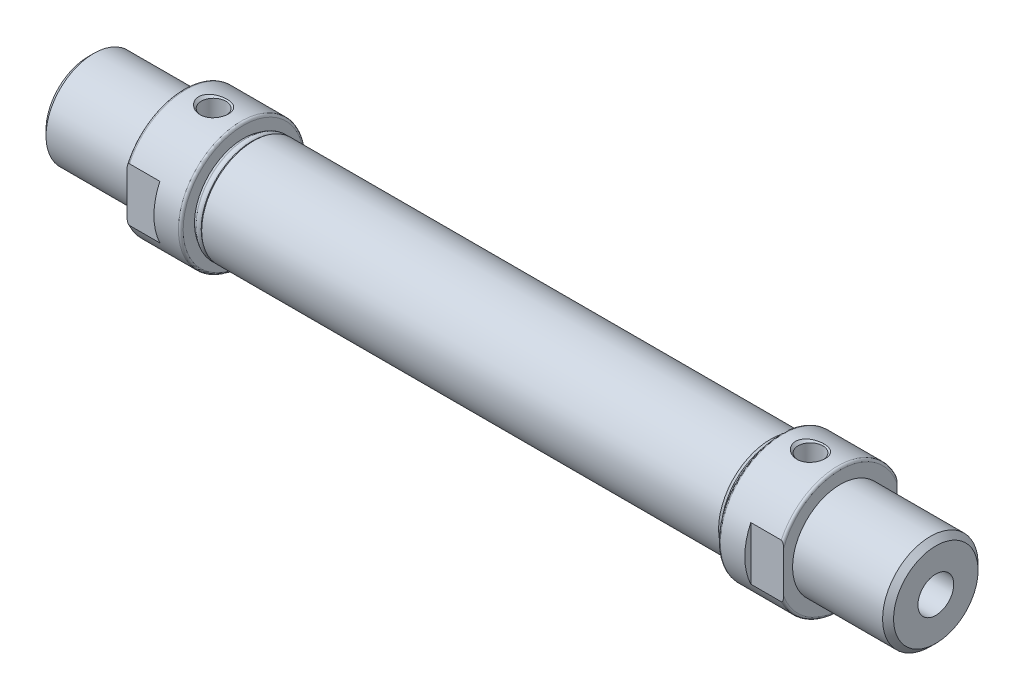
ISO-10303-21;
HEADER;
FILE_DESCRIPTION(('STEP AP214'),'2;1');
FILE_NAME('part.step','',(''),(''),'','','');
FILE_SCHEMA(('AUTOMOTIVE_DESIGN { 1 0 10303 214 1 1 1 1 }'));
ENDSEC;
DATA;
#1=APPLICATION_CONTEXT('core data for automotive mechanical design processes');
#2=APPLICATION_PROTOCOL_DEFINITION('international standard','automotive_design',2000,#1);
#3=PRODUCT_CONTEXT('',#1,'mechanical');
#4=PRODUCT('Part','Part','',(#3));
#5=PRODUCT_RELATED_PRODUCT_CATEGORY('part','',(#4));
#6=PRODUCT_DEFINITION_FORMATION('','',#4);
#7=PRODUCT_DEFINITION_CONTEXT('part definition',#1,'design');
#8=PRODUCT_DEFINITION('design','',#6,#7);
#9=PRODUCT_DEFINITION_SHAPE('','',#8);
#10=(LENGTH_UNIT() NAMED_UNIT(*) SI_UNIT(.MILLI.,.METRE.));
#11=(NAMED_UNIT(*) PLANE_ANGLE_UNIT() SI_UNIT($,.RADIAN.));
#12=(NAMED_UNIT(*) SI_UNIT($,.STERADIAN.) SOLID_ANGLE_UNIT());
#13=UNCERTAINTY_MEASURE_WITH_UNIT(LENGTH_MEASURE(1.E-05),#10,'distance_accuracy_value','');
#14=(GEOMETRIC_REPRESENTATION_CONTEXT(3) GLOBAL_UNCERTAINTY_ASSIGNED_CONTEXT((#13)) GLOBAL_UNIT_ASSIGNED_CONTEXT((#10,
#11,#12)) REPRESENTATION_CONTEXT('',''));
#15=CARTESIAN_POINT('',(0.,0.,0.));
#16=DIRECTION('',(0.,0.,1.));
#17=DIRECTION('',(1.,0.,0.));
#18=AXIS2_PLACEMENT_3D('',#15,#16,#17);
#19=CARTESIAN_POINT('',(142.,0.,0.));
#20=DIRECTION('',(-1.,0.,0.));
#21=DIRECTION('',(0.,0.,1.));
#22=AXIS2_PLACEMENT_3D('',#19,#20,#21);
#23=CYLINDRICAL_SURFACE('',#22,8.);
#24=CARTESIAN_POINT('',(36.,0.,0.));
#25=DIRECTION('',(-1.,0.,0.));
#26=DIRECTION('',(0.,0.,1.));
#27=AXIS2_PLACEMENT_3D('',#24,#25,#26);
#28=CIRCLE('',#27,8.);
#29=CARTESIAN_POINT('',(36.,0.,8.));
#30=VERTEX_POINT('',#29);
#31=EDGE_CURVE('E456',#30,#30,#28,.F.);
#32=ORIENTED_EDGE('',*,*,#31,.F.);
#33=EDGE_LOOP('',(#32));
#34=FACE_BOUND('',#33,.T.);
#35=CARTESIAN_POINT('',(106.,0.,0.));
#36=DIRECTION('',(-1.,0.,0.));
#37=DIRECTION('',(0.,0.,1.));
#38=AXIS2_PLACEMENT_3D('',#35,#36,#37);
#39=CIRCLE('',#38,8.);
#40=CARTESIAN_POINT('',(106.,0.,8.));
#41=VERTEX_POINT('',#40);
#42=EDGE_CURVE('E459',#41,#41,#39,.T.);
#43=ORIENTED_EDGE('',*,*,#42,.F.);
#44=EDGE_LOOP('',(#43));
#45=FACE_BOUND('',#44,.T.);
#46=ADVANCED_FACE('F17',(#34,#45),#23,.F.);
#47=CARTESIAN_POINT('',(106.,8.,0.));
#48=DIRECTION('',(-1.,0.,0.));
#49=DIRECTION('',(0.,0.,1.));
#50=AXIS2_PLACEMENT_3D('',#47,#48,#49);
#51=PLANE('',#50);
#52=CARTESIAN_POINT('',(106.,0.,0.));
#53=DIRECTION('',(-1.,0.,0.));
#54=DIRECTION('',(0.,0.,1.));
#55=AXIS2_PLACEMENT_3D('',#52,#53,#54);
#56=CIRCLE('',#55,3.);
#57=CARTESIAN_POINT('',(106.,0.,3.));
#58=VERTEX_POINT('',#57);
#59=EDGE_CURVE('E453',#58,#58,#56,.F.);
#60=ORIENTED_EDGE('',*,*,#59,.T.);
#61=EDGE_LOOP('',(#60));
#62=FACE_BOUND('',#61,.T.);
#63=ORIENTED_EDGE('',*,*,#42,.T.);
#64=EDGE_LOOP('',(#63));
#65=FACE_BOUND('',#64,.T.);
#66=ADVANCED_FACE('F1075',(#62,#65),#51,.T.);
#67=CARTESIAN_POINT('',(36.,3.,0.));
#68=DIRECTION('',(1.,0.,0.));
#69=DIRECTION('',(0.,0.,-1.));
#70=AXIS2_PLACEMENT_3D('',#67,#68,#69);
#71=PLANE('',#70);
#72=ORIENTED_EDGE('',*,*,#31,.T.);
#73=EDGE_LOOP('',(#72));
#74=FACE_BOUND('',#73,.T.);
#75=CARTESIAN_POINT('',(36.,0.,0.));
#76=DIRECTION('',(-1.,0.,0.));
#77=DIRECTION('',(0.,0.,1.));
#78=AXIS2_PLACEMENT_3D('',#75,#76,#77);
#79=CIRCLE('',#78,3.);
#80=CARTESIAN_POINT('',(36.,0.,3.));
#81=VERTEX_POINT('',#80);
#82=EDGE_CURVE('E450',#81,#81,#79,.T.);
#83=ORIENTED_EDGE('',*,*,#82,.T.);
#84=EDGE_LOOP('',(#83));
#85=FACE_BOUND('',#84,.T.);
#86=ADVANCED_FACE('F1065',(#74,#85),#71,.T.);
#87=CARTESIAN_POINT('',(142.,0.,0.));
#88=DIRECTION('',(-1.,0.,0.));
#89=DIRECTION('',(0.,0.,1.));
#90=AXIS2_PLACEMENT_3D('',#87,#88,#89);
#91=CYLINDRICAL_SURFACE('',#90,3.);
#92=CARTESIAN_POINT('',(142.,0.,0.));
#93=DIRECTION('',(-1.,0.,0.));
#94=DIRECTION('',(0.,0.,1.));
#95=AXIS2_PLACEMENT_3D('',#92,#93,#94);
#96=CIRCLE('',#95,3.);
#97=CARTESIAN_POINT('',(142.,0.,3.));
#98=VERTEX_POINT('',#97);
#99=EDGE_CURVE('E447',#98,#98,#96,.F.);
#100=ORIENTED_EDGE('',*,*,#99,.T.);
#101=EDGE_LOOP('',(#100));
#102=FACE_BOUND('',#101,.T.);
#103=ORIENTED_EDGE('',*,*,#59,.F.);
#104=EDGE_LOOP('',(#103));
#105=FACE_BOUND('',#104,.T.);
#106=ADVANCED_FACE('F1055',(#102,#105),#91,.F.);
#107=CARTESIAN_POINT('',(142.,0.,0.));
#108=DIRECTION('',(-1.,0.,0.));
#109=DIRECTION('',(0.,0.,1.));
#110=AXIS2_PLACEMENT_3D('',#107,#108,#109);
#111=CYLINDRICAL_SURFACE('',#110,3.);
#112=ORIENTED_EDGE('',*,*,#82,.F.);
#113=EDGE_LOOP('',(#112));
#114=FACE_BOUND('',#113,.T.);
#115=CARTESIAN_POINT('',(0.,0.,0.));
#116=DIRECTION('',(-1.,0.,0.));
#117=DIRECTION('',(0.,0.,1.));
#118=AXIS2_PLACEMENT_3D('',#115,#116,#117);
#119=CIRCLE('',#118,3.);
#120=CARTESIAN_POINT('',(0.,0.,3.));
#121=VERTEX_POINT('',#120);
#122=EDGE_CURVE('E444',#121,#121,#119,.T.);
#123=ORIENTED_EDGE('',*,*,#122,.T.);
#124=EDGE_LOOP('',(#123));
#125=FACE_BOUND('',#124,.T.);
#126=ADVANCED_FACE('F1045',(#114,#125),#111,.F.);
#127=CARTESIAN_POINT('',(142.,7.08,0.));
#128=DIRECTION('',(-1.,0.,0.));
#129=DIRECTION('',(0.,0.,1.));
#130=AXIS2_PLACEMENT_3D('',#127,#128,#129);
#131=PLANE('',#130);
#132=ORIENTED_EDGE('',*,*,#99,.F.);
#133=EDGE_LOOP('',(#132));
#134=FACE_BOUND('',#133,.T.);
#135=CARTESIAN_POINT('',(142.,0.,0.));
#136=DIRECTION('',(-1.,0.,0.));
#137=DIRECTION('',(0.,0.,1.));
#138=AXIS2_PLACEMENT_3D('',#135,#136,#137);
#139=CIRCLE('',#138,7.08);
#140=CARTESIAN_POINT('',(142.,0.,7.08));
#141=VERTEX_POINT('',#140);
#142=EDGE_CURVE('E441',#141,#141,#139,.T.);
#143=ORIENTED_EDGE('',*,*,#142,.F.);
#144=EDGE_LOOP('',(#143));
#145=FACE_BOUND('',#144,.T.);
#146=ADVANCED_FACE('F1035',(#134,#145),#131,.F.);
#147=CARTESIAN_POINT('',(0.,0.,0.));
#148=DIRECTION('',(1.,0.,0.));
#149=DIRECTION('',(0.,0.,-1.));
#150=AXIS2_PLACEMENT_3D('',#147,#148,#149);
#151=PLANE('',#150);
#152=ORIENTED_EDGE('',*,*,#122,.F.);
#153=EDGE_LOOP('',(#152));
#154=FACE_BOUND('',#153,.T.);
#155=CARTESIAN_POINT('',(0.,0.,0.));
#156=DIRECTION('',(1.,0.,0.));
#157=DIRECTION('',(0.,0.,-1.));
#158=AXIS2_PLACEMENT_3D('',#155,#156,#157);
#159=CIRCLE('',#158,7.08);
#160=CARTESIAN_POINT('',(0.,0.,-7.08));
#161=VERTEX_POINT('',#160);
#162=EDGE_CURVE('E233',#161,#161,#159,.T.);
#163=ORIENTED_EDGE('',*,*,#162,.F.);
#164=EDGE_LOOP('',(#163));
#165=FACE_BOUND('',#164,.T.);
#166=ADVANCED_FACE('F1025',(#154,#165),#151,.F.);
#167=CARTESIAN_POINT('',(141.08,0.,0.));
#168=DIRECTION('',(-1.,0.,0.));
#169=DIRECTION('',(0.,0.,1.));
#170=AXIS2_PLACEMENT_3D('',#167,#168,#169);
#171=CONICAL_SURFACE('',#170,8.,0.785398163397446);
#172=ORIENTED_EDGE('',*,*,#142,.T.);
#173=EDGE_LOOP('',(#172));
#174=FACE_BOUND('',#173,.T.);
#175=CARTESIAN_POINT('',(141.08,0.,0.));
#176=DIRECTION('',(-1.,0.,0.));
#177=DIRECTION('',(0.,0.,1.));
#178=AXIS2_PLACEMENT_3D('',#175,#176,#177);
#179=CIRCLE('',#178,8.);
#180=CARTESIAN_POINT('',(141.08,0.,8.));
#181=VERTEX_POINT('',#180);
#182=EDGE_CURVE('E230',#181,#181,#179,.T.);
#183=ORIENTED_EDGE('',*,*,#182,.F.);
#184=EDGE_LOOP('',(#183));
#185=FACE_BOUND('',#184,.T.);
#186=ADVANCED_FACE('F585',(#174,#185),#171,.T.);
#187=CARTESIAN_POINT('',(0.920000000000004,0.,0.));
#188=DIRECTION('',(1.,0.,0.));
#189=DIRECTION('',(0.,0.,-1.));
#190=AXIS2_PLACEMENT_3D('',#187,#188,#189);
#191=CONICAL_SURFACE('',#190,8.,0.785398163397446);
#192=CARTESIAN_POINT('',(0.920000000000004,0.,0.));
#193=DIRECTION('',(-1.,0.,0.));
#194=DIRECTION('',(0.,0.,1.));
#195=AXIS2_PLACEMENT_3D('',#192,#193,#194);
#196=CIRCLE('',#195,8.);
#197=CARTESIAN_POINT('',(0.920000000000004,0.,8.));
#198=VERTEX_POINT('',#197);
#199=EDGE_CURVE('E221',#198,#198,#196,.F.);
#200=ORIENTED_EDGE('',*,*,#199,.F.);
#201=EDGE_LOOP('',(#200));
#202=FACE_BOUND('',#201,.T.);
#203=ORIENTED_EDGE('',*,*,#162,.T.);
#204=EDGE_LOOP('',(#203));
#205=FACE_BOUND('',#204,.T.);
#206=ADVANCED_FACE('F575',(#202,#205),#191,.T.);
#207=CARTESIAN_POINT('',(123.067,3.75,0.));
#208=DIRECTION('',(0.,1.,0.));
#209=DIRECTION('',(0.,0.,1.));
#210=AXIS2_PLACEMENT_3D('',#207,#208,#209);
#211=PLANE('',#210);
#212=CARTESIAN_POINT('',(121.,3.75,0.));
#213=DIRECTION('',(0.,1.,0.));
#214=DIRECTION('',(0.,0.,1.));
#215=AXIS2_PLACEMENT_3D('',#212,#213,#214);
#216=CIRCLE('',#215,2.06700000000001);
#217=CARTESIAN_POINT('',(121.,3.75,2.06700000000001));
#218=VERTEX_POINT('',#217);
#219=EDGE_CURVE('E229',#218,#218,#216,.T.);
#220=ORIENTED_EDGE('',*,*,#219,.T.);
#221=EDGE_LOOP('',(#220));
#222=FACE_BOUND('',#221,.T.);
#223=ADVANCED_FACE('F572',(#222),#211,.T.);
#224=CARTESIAN_POINT('',(142.,0.,0.));
#225=DIRECTION('',(-1.,0.,0.));
#226=DIRECTION('',(0.,0.,1.));
#227=AXIS2_PLACEMENT_3D('',#224,#225,#226);
#228=CYLINDRICAL_SURFACE('',#227,8.);
#229=ORIENTED_EDGE('',*,*,#182,.T.);
#230=EDGE_LOOP('',(#229));
#231=FACE_BOUND('',#230,.T.);
#232=CARTESIAN_POINT('',(126.,0.,0.));
#233=DIRECTION('',(-1.,0.,0.));
#234=DIRECTION('',(0.,0.,1.));
#235=AXIS2_PLACEMENT_3D('',#232,#233,#234);
#236=CIRCLE('',#235,8.);
#237=CARTESIAN_POINT('',(126.,0.,8.));
#238=VERTEX_POINT('',#237);
#239=EDGE_CURVE('E434',#238,#238,#236,.F.);
#240=ORIENTED_EDGE('',*,*,#239,.T.);
#241=EDGE_LOOP('',(#240));
#242=FACE_BOUND('',#241,.T.);
#243=ADVANCED_FACE('F574',(#231,#242),#228,.T.);
#244=CARTESIAN_POINT('',(23.067,3.75,0.));
#245=DIRECTION('',(0.,1.,0.));
#246=DIRECTION('',(0.,0.,1.));
#247=AXIS2_PLACEMENT_3D('',#244,#245,#246);
#248=PLANE('',#247);
#249=CARTESIAN_POINT('',(21.,3.75,0.));
#250=DIRECTION('',(0.,1.,0.));
#251=DIRECTION('',(0.,0.,1.));
#252=AXIS2_PLACEMENT_3D('',#249,#250,#251);
#253=CIRCLE('',#252,2.067);
#254=CARTESIAN_POINT('',(21.,3.75,2.067));
#255=VERTEX_POINT('',#254);
#256=EDGE_CURVE('E431',#255,#255,#253,.T.);
#257=ORIENTED_EDGE('',*,*,#256,.T.);
#258=EDGE_LOOP('',(#257));
#259=FACE_BOUND('',#258,.T.);
#260=ADVANCED_FACE('F582',(#259),#248,.T.);
#261=CARTESIAN_POINT('',(126.,0.,0.));
#262=DIRECTION('',(-1.,0.,0.));
#263=DIRECTION('',(0.,0.,1.));
#264=AXIS2_PLACEMENT_3D('',#261,#262,#263);
#265=CYLINDRICAL_SURFACE('',#264,8.);
#266=ORIENTED_EDGE('',*,*,#199,.T.);
#267=EDGE_LOOP('',(#266));
#268=FACE_BOUND('',#267,.T.);
#269=CARTESIAN_POINT('',(16.,0.,0.));
#270=DIRECTION('',(-1.,0.,0.));
#271=DIRECTION('',(0.,0.,1.));
#272=AXIS2_PLACEMENT_3D('',#269,#270,#271);
#273=CIRCLE('',#272,8.);
#274=CARTESIAN_POINT('',(16.,0.,8.));
#275=VERTEX_POINT('',#274);
#276=EDGE_CURVE('E427',#275,#275,#273,.T.);
#277=ORIENTED_EDGE('',*,*,#276,.T.);
#278=EDGE_LOOP('',(#277));
#279=FACE_BOUND('',#278,.T.);
#280=ADVANCED_FACE('F569',(#268,#279),#265,.T.);
#281=CARTESIAN_POINT('',(121.,3.75,0.));
#282=DIRECTION('',(0.,1.,0.));
#283=DIRECTION('',(0.,0.,1.));
#284=AXIS2_PLACEMENT_3D('',#281,#282,#283);
#285=CYLINDRICAL_SURFACE('',#284,2.06700000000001);
#286=CARTESIAN_POINT('',(121.,10.0669999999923,0.));
#287=DIRECTION('',(0.,1.,0.));
#288=DIRECTION('',(0.,0.,1.));
#289=AXIS2_PLACEMENT_3D('',#286,#287,#288);
#290=CIRCLE('',#289,2.06700000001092);
#291=CARTESIAN_POINT('',(121.,10.0669999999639,-2.06699999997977));
#292=VERTEX_POINT('',#291);
#293=CARTESIAN_POINT('',(121.,10.0669999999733,2.06699999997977));
#294=VERTEX_POINT('',#293);
#295=EDGE_CURVE('E178',#292,#294,#290,.T.);
#296=ORIENTED_EDGE('',*,*,#295,.T.);
#297=CARTESIAN_POINT('',(121.,10.0669999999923,0.));
#298=DIRECTION('',(0.,1.,0.));
#299=DIRECTION('',(0.,0.,1.));
#300=AXIS2_PLACEMENT_3D('',#297,#298,#299);
#301=CIRCLE('',#300,2.06700000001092);
#302=EDGE_CURVE('E173',#294,#292,#301,.T.);
#303=ORIENTED_EDGE('',*,*,#302,.T.);
#304=EDGE_LOOP('',(#296,#303));
#305=FACE_BOUND('',#304,.T.);
#306=ORIENTED_EDGE('',*,*,#219,.F.);
#307=EDGE_LOOP('',(#306));
#308=FACE_BOUND('',#307,.T.);
#309=ADVANCED_FACE('F383',(#305,#308),#285,.F.);
#310=CARTESIAN_POINT('',(126.,10.1,0.));
#311=DIRECTION('',(-1.,0.,0.));
#312=DIRECTION('',(0.,0.,1.));
#313=AXIS2_PLACEMENT_3D('',#310,#311,#312);
#314=PLANE('',#313);
#315=CARTESIAN_POINT('',(126.,0.,0.));
#316=DIRECTION('',(-1.,0.,0.));
#317=DIRECTION('',(0.,-0.339533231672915,-0.940594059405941));
#318=AXIS2_PLACEMENT_3D('',#315,#316,#317);
#319=CIRCLE('',#318,10.1);
#320=CARTESIAN_POINT('',(126.,-3.42928563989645,-9.5));
#321=VERTEX_POINT('',#320);
#322=CARTESIAN_POINT('',(126.,-3.42928563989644,9.5));
#323=VERTEX_POINT('',#322);
#324=EDGE_CURVE('E430',#321,#323,#319,.T.);
#325=ORIENTED_EDGE('',*,*,#324,.F.);
#326=DIRECTION('',(0.,1.,0.));
#327=VECTOR('',#326,1.);
#328=CARTESIAN_POINT('',(126.,-10.5,-9.5));
#329=LINE('',#328,#327);
#330=CARTESIAN_POINT('',(126.,3.4292856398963,-9.50000000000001));
#331=VERTEX_POINT('',#330);
#332=EDGE_CURVE('E540',#331,#321,#329,.F.);
#333=ORIENTED_EDGE('',*,*,#332,.F.);
#334=CARTESIAN_POINT('',(126.,0.,0.));
#335=DIRECTION('',(-1.,0.,0.));
#336=DIRECTION('',(0.,0.339533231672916,0.940594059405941));
#337=AXIS2_PLACEMENT_3D('',#334,#335,#336);
#338=CIRCLE('',#337,10.1);
#339=CARTESIAN_POINT('',(126.,3.42928563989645,9.5));
#340=VERTEX_POINT('',#339);
#341=EDGE_CURVE('E141',#340,#331,#338,.T.);
#342=ORIENTED_EDGE('',*,*,#341,.F.);
#343=DIRECTION('',(0.,1.,0.));
#344=VECTOR('',#343,1.);
#345=CARTESIAN_POINT('',(126.,10.5,9.5));
#346=LINE('',#345,#344);
#347=EDGE_CURVE('E138',#323,#340,#346,.T.);
#348=ORIENTED_EDGE('',*,*,#347,.F.);
#349=EDGE_LOOP('',(#325,#333,#342,#348));
#350=FACE_BOUND('',#349,.T.);
#351=ORIENTED_EDGE('',*,*,#239,.F.);
#352=EDGE_LOOP('',(#351));
#353=FACE_BOUND('',#352,.T.);
#354=ADVANCED_FACE('F373',(#350,#353),#314,.F.);
#355=CARTESIAN_POINT('',(21.,3.75,0.));
#356=DIRECTION('',(0.,1.,0.));
#357=DIRECTION('',(0.,0.,1.));
#358=AXIS2_PLACEMENT_3D('',#355,#356,#357);
#359=CYLINDRICAL_SURFACE('',#358,2.067);
#360=CARTESIAN_POINT('',(21.,10.0670000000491,0.));
#361=DIRECTION('',(0.,1.,0.));
#362=DIRECTION('',(0.,0.,1.));
#363=AXIS2_PLACEMENT_3D('',#360,#361,#362);
#364=CIRCLE('',#363,2.06700000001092);
#365=CARTESIAN_POINT('',(21.,10.0670000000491,2.06700000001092));
#366=VERTEX_POINT('',#365);
#367=EDGE_CURVE('E323',#366,#366,#364,.T.);
#368=ORIENTED_EDGE('',*,*,#367,.T.);
#369=EDGE_LOOP('',(#368));
#370=FACE_BOUND('',#369,.T.);
#371=ORIENTED_EDGE('',*,*,#256,.F.);
#372=EDGE_LOOP('',(#371));
#373=FACE_BOUND('',#372,.T.);
#374=ADVANCED_FACE('F382',(#370,#373),#359,.F.);
#375=CARTESIAN_POINT('',(16.,8.,0.));
#376=DIRECTION('',(1.,0.,0.));
#377=DIRECTION('',(0.,0.,-1.));
#378=AXIS2_PLACEMENT_3D('',#375,#376,#377);
#379=PLANE('',#378);
#380=DIRECTION('',(0.,1.,0.));
#381=VECTOR('',#380,1.);
#382=CARTESIAN_POINT('',(16.,10.5,9.5));
#383=LINE('',#382,#381);
#384=CARTESIAN_POINT('',(16.,-3.42928563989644,9.5));
#385=VERTEX_POINT('',#384);
#386=CARTESIAN_POINT('',(16.,3.42928563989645,9.5));
#387=VERTEX_POINT('',#386);
#388=EDGE_CURVE('E292',#385,#387,#383,.T.);
#389=ORIENTED_EDGE('',*,*,#388,.T.);
#390=CARTESIAN_POINT('',(16.,0.,0.));
#391=DIRECTION('',(1.,0.,0.));
#392=DIRECTION('',(0.,0.339533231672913,-0.940594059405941));
#393=AXIS2_PLACEMENT_3D('',#390,#391,#392);
#394=CIRCLE('',#393,10.1);
#395=CARTESIAN_POINT('',(16.,3.42928563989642,-9.5));
#396=VERTEX_POINT('',#395);
#397=EDGE_CURVE('E328',#396,#387,#394,.T.);
#398=ORIENTED_EDGE('',*,*,#397,.F.);
#399=DIRECTION('',(0.,1.,0.));
#400=VECTOR('',#399,1.);
#401=CARTESIAN_POINT('',(16.,-10.5,-9.5));
#402=LINE('',#401,#400);
#403=CARTESIAN_POINT('',(16.,-3.42928563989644,-9.5));
#404=VERTEX_POINT('',#403);
#405=EDGE_CURVE('E320',#396,#404,#402,.F.);
#406=ORIENTED_EDGE('',*,*,#405,.T.);
#407=CARTESIAN_POINT('',(16.,0.,0.));
#408=DIRECTION('',(1.,0.,0.));
#409=DIRECTION('',(0.,-0.339533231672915,0.940594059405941));
#410=AXIS2_PLACEMENT_3D('',#407,#408,#409);
#411=CIRCLE('',#410,10.1);
#412=EDGE_CURVE('E539',#385,#404,#411,.T.);
#413=ORIENTED_EDGE('',*,*,#412,.F.);
#414=EDGE_LOOP('',(#389,#398,#406,#413));
#415=FACE_BOUND('',#414,.T.);
#416=ORIENTED_EDGE('',*,*,#276,.F.);
#417=EDGE_LOOP('',(#416));
#418=FACE_BOUND('',#417,.T.);
#419=ADVANCED_FACE('F198',(#415,#418),#379,.F.);
#420=CARTESIAN_POINT('',(125.6,0.,0.));
#421=DIRECTION('',(-1.,0.,0.));
#422=DIRECTION('',(0.,0.,1.));
#423=AXIS2_PLACEMENT_3D('',#420,#421,#422);
#424=TOROIDAL_SURFACE('',#423,10.1,0.400000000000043);
#425=CARTESIAN_POINT('',(126.,-3.42928563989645,-9.5));
#426=CARTESIAN_POINT('',(125.999966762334,-3.48288224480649,-9.50000000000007));
#427=CARTESIAN_POINT('',(125.998753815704,-3.53650979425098,-9.50000000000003));
#428=CARTESIAN_POINT('',(125.993435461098,-3.64386324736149,-9.49999999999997));
#429=CARTESIAN_POINT('',(125.989316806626,-3.69758847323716,-9.49999999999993));
#430=CARTESIAN_POINT('',(125.977683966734,-3.80431725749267,-9.50000000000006));
#431=CARTESIAN_POINT('',(125.970192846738,-3.85732323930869,-9.50000000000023));
#432=CARTESIAN_POINT('',(125.950979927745,-3.96249904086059,-9.49999999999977));
#433=CARTESIAN_POINT('',(125.939266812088,-4.01467034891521,-9.49999999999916));
#434=CARTESIAN_POINT('',(125.917235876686,-4.09248292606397,-9.49999999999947));
#435=CARTESIAN_POINT('',(125.909000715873,-4.11870921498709,-9.49999999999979));
#436=CARTESIAN_POINT('',(125.890654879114,-4.17067258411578,-9.50000000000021));
#437=CARTESIAN_POINT('',(125.880533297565,-4.19640580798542,-9.50000000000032));
#438=CARTESIAN_POINT('',(125.85425853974,-4.25534717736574,-9.49999999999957));
#439=CARTESIAN_POINT('',(125.837219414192,-4.28818822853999,-9.49999999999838));
#440=CARTESIAN_POINT('',(125.807490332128,-4.33464943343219,-9.5000000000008));
#441=CARTESIAN_POINT('',(125.796934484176,-4.34961706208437,-9.5000000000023));
#442=CARTESIAN_POINT('',(125.774153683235,-4.37820358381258,-9.4999999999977));
#443=CARTESIAN_POINT('',(125.761929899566,-4.39182341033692,-9.49999999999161));
#444=CARTESIAN_POINT('',(125.730568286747,-4.42165756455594,-9.49999999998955));
#445=CARTESIAN_POINT('',(125.71053118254,-4.43701974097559,-9.49999999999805));
#446=CARTESIAN_POINT('',(125.677369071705,-4.45476883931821,-9.50000000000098));
#447=CARTESIAN_POINT('',(125.665686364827,-4.45982215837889,-9.50000000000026));
#448=CARTESIAN_POINT('',(125.641560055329,-4.46748212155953,-9.49999999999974));
#449=CARTESIAN_POINT('',(125.629119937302,-4.47009918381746,-9.49999999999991));
#450=CARTESIAN_POINT('',(125.611055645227,-4.47187043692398,-9.50000000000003));
#451=CARTESIAN_POINT('',(125.605527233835,-4.47214397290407,-9.50000000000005));
#452=CARTESIAN_POINT('',(125.6,-4.47213595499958,-9.5));
#453=B_SPLINE_CURVE_WITH_KNOTS('',3,(#425,#426,#427,#428,#429,#430,#431,#432,#433,#434,#435,
#436,#437,#438,#439,#440,#441,#442,#443,#444,#445,#446,#447,#448,#449,#450,#451,#452),
.UNSPECIFIED.,.F.,.F.,(4,2,2,2,2,2,2,2,2,2,2,2,2,4),(0.,0.160825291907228,0.322388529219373,
0.482863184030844,0.643009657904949,0.725418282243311,0.808318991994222,0.918848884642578,
0.9736899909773,1.02849284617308,1.10318375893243,1.14116883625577,1.17899072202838,
1.19557156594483),.UNSPECIFIED.);
#454=CARTESIAN_POINT('',(125.6,-4.47213595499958,-9.5));
#455=VERTEX_POINT('',#454);
#456=EDGE_CURVE('E538',#321,#455,#453,.T.);
#457=ORIENTED_EDGE('',*,*,#456,.F.);
#458=ORIENTED_EDGE('',*,*,#324,.T.);
#459=CARTESIAN_POINT('',(125.6,-4.47213595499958,9.5));
#460=CARTESIAN_POINT('',(125.610514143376,-4.47216378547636,9.5));
#461=CARTESIAN_POINT('',(125.620991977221,-4.47116407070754,9.5));
#462=CARTESIAN_POINT('',(125.641499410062,-4.46736714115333,9.5));
#463=CARTESIAN_POINT('',(125.651532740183,-4.46459040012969,9.5));
#464=CARTESIAN_POINT('',(125.673334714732,-4.45664513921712,9.5));
#465=CARTESIAN_POINT('',(125.684951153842,-4.4510657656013,9.5));
#466=CARTESIAN_POINT('',(125.707166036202,-4.43810179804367,9.5));
#467=CARTESIAN_POINT('',(125.71775943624,-4.43070883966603,9.5));
#468=CARTESIAN_POINT('',(125.743865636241,-4.40985262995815,9.5));
#469=CARTESIAN_POINT('',(125.758570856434,-4.39538928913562,9.5));
#470=CARTESIAN_POINT('',(125.785702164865,-4.36449939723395,9.5));
#471=CARTESIAN_POINT('',(125.798123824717,-4.34806913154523,9.5));
#472=CARTESIAN_POINT('',(125.821022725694,-4.31410030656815,9.5));
#473=CARTESIAN_POINT('',(125.831513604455,-4.29657079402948,9.5));
#474=CARTESIAN_POINT('',(125.85099968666,-4.26069020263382,9.5));
#475=CARTESIAN_POINT('',(125.859993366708,-4.24233831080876,9.5));
#476=CARTESIAN_POINT('',(125.876781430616,-4.20495095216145,9.5));
#477=CARTESIAN_POINT('',(125.884567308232,-4.18591170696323,9.5));
#478=CARTESIAN_POINT('',(125.89905338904,-4.14744025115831,9.5));
#479=CARTESIAN_POINT('',(125.905754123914,-4.12800823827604,9.5));
#480=CARTESIAN_POINT('',(125.923855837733,-4.07118130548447,9.49999999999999));
#481=CARTESIAN_POINT('',(125.934042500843,-4.0333988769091,9.5));
#482=CARTESIAN_POINT('',(125.9517866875,-3.95717407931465,9.5));
#483=CARTESIAN_POINT('',(125.95933949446,-3.91873065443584,9.5));
#484=CARTESIAN_POINT('',(125.972273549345,-3.84140900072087,9.5));
#485=CARTESIAN_POINT('',(125.977650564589,-3.80253007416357,9.5));
#486=CARTESIAN_POINT('',(125.98632931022,-3.72643416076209,9.5));
#487=CARTESIAN_POINT('',(125.989718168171,-3.68922684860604,9.5));
#488=CARTESIAN_POINT('',(125.995011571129,-3.61480389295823,9.5));
#489=CARTESIAN_POINT('',(125.996919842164,-3.57758850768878,9.5));
#490=CARTESIAN_POINT('',(125.999406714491,-3.50334192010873,9.5));
#491=CARTESIAN_POINT('',(125.999993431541,-3.46631099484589,9.5));
#492=CARTESIAN_POINT('',(126.,-3.42928563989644,9.49999999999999));
#493=B_SPLINE_CURVE_WITH_KNOTS('',3,(#459,#460,#461,#462,#463,#464,#465,#466,#467,#468,#469,
#470,#471,#472,#473,#474,#475,#476,#477,#478,#479,#480,#481,#482,#483,#484,#485,#486,#487,#488,
#489,#490,#491,#492),.UNSPECIFIED.,.F.,.F.,(4,2,2,2,2,2,2,2,2,2,2,2,2,2,2,2,4),(0.,
0.03143636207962,0.062516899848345,0.100962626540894,0.139589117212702,0.201119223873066,
0.262767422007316,0.323961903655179,0.385218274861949,0.446888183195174,0.508527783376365,
0.625784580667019,0.743250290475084,0.860943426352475,0.972994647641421,1.08476295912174,
1.19584300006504),.UNSPECIFIED.);
#494=CARTESIAN_POINT('',(125.6,-4.47213595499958,9.5));
#495=VERTEX_POINT('',#494);
#496=EDGE_CURVE('E166',#495,#323,#493,.T.);
#497=ORIENTED_EDGE('',*,*,#496,.F.);
#498=CARTESIAN_POINT('',(125.6,0.,0.));
#499=DIRECTION('',(-1.,0.,0.));
#500=DIRECTION('',(0.,0.,1.));
#501=AXIS2_PLACEMENT_3D('',#498,#499,#500);
#502=CIRCLE('',#501,10.5);
#503=EDGE_CURVE('E184',#455,#495,#502,.T.);
#504=ORIENTED_EDGE('',*,*,#503,.F.);
#505=EDGE_LOOP('',(#457,#458,#497,#504));
#506=FACE_BOUND('',#505,.T.);
#507=ADVANCED_FACE('F192',(#506),#424,.T.);
#508=CARTESIAN_POINT('',(121.,10.5027149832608,0.));
#509=DIRECTION('',(0.,1.,0.));
#510=DIRECTION('',(0.,0.,1.));
#511=AXIS2_PLACEMENT_3D('',#508,#509,#510);
#512=CONICAL_SURFACE('',#511,2.50271498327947,0.785398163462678);
#513=ORIENTED_EDGE('',*,*,#302,.F.);
#514=DIRECTION('',(0.,-0.70710678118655,-0.707106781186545));
#515=VECTOR('',#514,1.);
#516=CARTESIAN_POINT('',(121.,499000.,498991.999999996));
#517=LINE('',#516,#515);
#518=CARTESIAN_POINT('',(121.,10.2549980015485,2.25499800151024));
#519=VERTEX_POINT('',#518);
#520=EDGE_CURVE('E170',#294,#519,#517,.F.);
#521=ORIENTED_EDGE('',*,*,#520,.T.);
#522=CARTESIAN_POINT('',(121.,10.2549980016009,-2.2549980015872));
#523=CARTESIAN_POINT('',(121.075316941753,10.2549909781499,-2.25500196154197));
#524=CARTESIAN_POINT('',(121.150631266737,10.2556780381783,-2.25190468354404));
#525=CARTESIAN_POINT('',(121.300730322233,10.2583885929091,-2.23953943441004));
#526=CARTESIAN_POINT('',(121.375515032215,10.2604121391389,-2.23027122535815));
#527=CARTESIAN_POINT('',(121.524103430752,10.2657467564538,-2.20558280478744));
#528=CARTESIAN_POINT('',(121.597905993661,10.269059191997,-2.19015607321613));
#529=CARTESIAN_POINT('',(121.743888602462,10.2768647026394,-2.15323100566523));
#530=CARTESIAN_POINT('',(121.816068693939,10.2813577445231,-2.13173284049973));
#531=CARTESIAN_POINT('',(122.029198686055,10.2964031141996,-2.0583061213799));
#532=CARTESIAN_POINT('',(122.167073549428,10.3085346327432,-1.99738980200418));
#533=CARTESIAN_POINT('',(122.429853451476,10.3355159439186,-1.85269797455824));
#534=CARTESIAN_POINT('',(122.554764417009,10.350364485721,-1.76893297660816));
#535=CARTESIAN_POINT('',(122.783174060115,10.3803428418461,-1.58334774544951));
#536=CARTESIAN_POINT('',(122.887267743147,10.3954447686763,-1.48225940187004));
#537=CARTESIAN_POINT('',(123.074880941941,10.424434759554,-1.26230185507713));
#538=CARTESIAN_POINT('',(123.158411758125,10.4383234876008,-1.14344247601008));
#539=CARTESIAN_POINT('',(123.293861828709,10.4617288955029,-0.903005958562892));
#540=CARTESIAN_POINT('',(123.347998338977,10.4715320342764,-0.782709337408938));
#541=CARTESIAN_POINT('',(123.432714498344,10.4871564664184,-0.533868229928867));
#542=CARTESIAN_POINT('',(123.46331789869,10.4929817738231,-0.40533220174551));
#543=CARTESIAN_POINT('',(123.497107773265,10.4994355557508,-0.159128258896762));
#544=CARTESIAN_POINT('',(123.502955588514,10.5005681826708,-0.0418335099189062));
#545=CARTESIAN_POINT('',(123.494253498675,10.4988952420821,0.191953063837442));
#546=CARTESIAN_POINT('',(123.479708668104,10.4960906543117,0.308445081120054));
#547=CARTESIAN_POINT('',(123.432074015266,10.4870831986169,0.532053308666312));
#548=CARTESIAN_POINT('',(123.399822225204,10.4810341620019,0.639356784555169));
#549=CARTESIAN_POINT('',(123.318826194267,10.4662752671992,0.84732666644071));
#550=CARTESIAN_POINT('',(123.270079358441,10.4575649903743,0.947992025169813));
#551=CARTESIAN_POINT('',(123.155140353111,10.4378326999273,1.14542148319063));
#552=CARTESIAN_POINT('',(123.088195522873,10.4267166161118,1.24173633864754));
#553=CARTESIAN_POINT('',(122.940521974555,10.4035321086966,1.42298467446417));
#554=CARTESIAN_POINT('',(122.859788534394,10.3914633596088,1.50791423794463));
#555=CARTESIAN_POINT('',(122.677967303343,10.3661940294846,1.67323783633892));
#556=CARTESIAN_POINT('',(122.575640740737,10.353004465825,1.75227088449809));
#557=CARTESIAN_POINT('',(122.359972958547,10.3280409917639,1.89387211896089));
#558=CARTESIAN_POINT('',(122.246624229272,10.3162680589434,1.95642897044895));
#559=CARTESIAN_POINT('',(122.000414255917,10.2942247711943,2.06943942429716));
#560=CARTESIAN_POINT('',(121.866725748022,10.2842093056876,2.11814086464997));
#561=CARTESIAN_POINT('',(121.59321858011,10.2683091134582,2.1939336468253));
#562=CARTESIAN_POINT('',(121.453406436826,10.2624201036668,2.22104739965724));
#563=CARTESIAN_POINT('',(121.26054000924,10.2576018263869,2.2431284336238));
#564=CARTESIAN_POINT('',(121.208486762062,10.2566261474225,2.24758269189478));
#565=CARTESIAN_POINT('',(121.104295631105,10.2553247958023,2.25351367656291));
#566=CARTESIAN_POINT('',(121.052158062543,10.2549979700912,2.25499568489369));
#567=CARTESIAN_POINT('',(121.,10.2549980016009,2.25499800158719));
#568=B_SPLINE_CURVE_WITH_KNOTS('',3,(#522,#523,#524,#525,#526,#527,#528,#529,#530,#531,#532,
#533,#534,#535,#536,#537,#538,#539,#540,#541,#542,#543,#544,#545,#546,#547,#548,#549,#550,#551,
#552,#553,#554,#555,#556,#557,#558,#559,#560,#561,#562,#563,#564,#565,#566,#567),.UNSPECIFIED.,
.F.,.F.,(4,2,2,2,2,2,2,2,2,2,2,2,2,2,2,2,2,2,2,2,2,2,4),(0.,0.225879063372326,0.451766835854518,
0.677894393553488,0.904015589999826,1.35525084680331,1.80627888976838,2.24157104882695,
2.67662345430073,3.07122035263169,3.46541847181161,3.81595371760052,4.16640175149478,
4.50153803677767,4.8367270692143,5.18873588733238,5.5408654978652,5.92914938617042,
6.31769970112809,6.74377168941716,7.16940077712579,7.3260905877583,7.48250170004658),.UNSPECIFIED.);
#569=CARTESIAN_POINT('',(121.,10.2549980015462,-2.25499800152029));
#570=VERTEX_POINT('',#569);
#571=EDGE_CURVE('E183',#570,#519,#568,.T.);
#572=ORIENTED_EDGE('',*,*,#571,.F.);
#573=DIRECTION('',(0.,-0.70710678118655,0.707106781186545));
#574=VECTOR('',#573,1.);
#575=CARTESIAN_POINT('',(121.000000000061,499000.,-498991.999999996));
#576=LINE('',#575,#574);
#577=EDGE_CURVE('E172',#570,#292,#576,.T.);
#578=ORIENTED_EDGE('',*,*,#577,.T.);
#579=EDGE_LOOP('',(#513,#521,#572,#578));
#580=FACE_BOUND('',#579,.T.);
#581=ADVANCED_FACE('F197',(#580),#512,.F.);
#582=CARTESIAN_POINT('',(121.,10.5026219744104,0.));
#583=DIRECTION('',(0.,1.,0.));
#584=DIRECTION('',(0.,0.,1.));
#585=AXIS2_PLACEMENT_3D('',#582,#583,#584);
#586=CONICAL_SURFACE('',#585,2.50262197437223,0.785398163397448);
#587=ORIENTED_EDGE('',*,*,#577,.F.);
#588=CARTESIAN_POINT('',(121.,10.2549980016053,2.25499800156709));
#589=CARTESIAN_POINT('',(120.924683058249,10.2549909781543,2.25500196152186));
#590=CARTESIAN_POINT('',(120.849368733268,10.2556780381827,2.25190468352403));
#591=CARTESIAN_POINT('',(120.699269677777,10.2583885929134,2.23953943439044));
#592=CARTESIAN_POINT('',(120.624484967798,10.260412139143,2.23027122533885));
#593=CARTESIAN_POINT('',(120.475896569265,10.2657467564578,2.20558280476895));
#594=CARTESIAN_POINT('',(120.402094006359,10.2690591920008,2.19015607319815));
#595=CARTESIAN_POINT('',(120.256111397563,10.2768647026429,2.15323100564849));
#596=CARTESIAN_POINT('',(120.183931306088,10.2813577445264,2.13173284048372));
#597=CARTESIAN_POINT('',(119.970801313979,10.2964031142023,2.05830612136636));
#598=CARTESIAN_POINT('',(119.832926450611,10.3085346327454,1.99738980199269));
#599=CARTESIAN_POINT('',(119.570146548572,10.3355159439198,1.85269797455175));
#600=CARTESIAN_POINT('',(119.445235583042,10.3503644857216,1.76893297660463));
#601=CARTESIAN_POINT('',(119.216825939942,10.3803428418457,1.58334774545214));
#602=CARTESIAN_POINT('',(119.112732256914,10.3954447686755,1.48225940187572));
#603=CARTESIAN_POINT('',(118.925119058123,10.4244347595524,1.26230185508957));
#604=CARTESIAN_POINT('',(118.841588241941,10.438323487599,1.14344247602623));
#605=CARTESIAN_POINT('',(118.706138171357,10.461728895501,0.903005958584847));
#606=CARTESIAN_POINT('',(118.652001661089,10.4715320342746,0.782709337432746));
#607=CARTESIAN_POINT('',(118.567285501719,10.487156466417,0.533868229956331));
#608=CARTESIAN_POINT('',(118.536682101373,10.4929817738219,0.405332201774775));
#609=CARTESIAN_POINT('',(118.502892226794,10.4994355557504,0.159128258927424));
#610=CARTESIAN_POINT('',(118.497044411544,10.5005681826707,0.0418335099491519));
#611=CARTESIAN_POINT('',(118.505746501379,10.4988952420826,-0.191953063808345));
#612=CARTESIAN_POINT('',(118.520291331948,10.4960906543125,-0.308445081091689));
#613=CARTESIAN_POINT('',(118.567925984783,10.4870831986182,-0.532053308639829));
#614=CARTESIAN_POINT('',(118.600177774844,10.4810341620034,-0.639356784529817));
#615=CARTESIAN_POINT('',(118.681173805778,10.4662752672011,-0.847326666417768));
#616=CARTESIAN_POINT('',(118.729920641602,10.4575649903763,-0.94799202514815));
#617=CARTESIAN_POINT('',(118.84485964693,10.4378326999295,-1.14542148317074));
#618=CARTESIAN_POINT('',(118.911804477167,10.4267166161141,-1.24173633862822));
#619=CARTESIAN_POINT('',(119.059478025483,10.4035321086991,-1.42298467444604));
#620=CARTESIAN_POINT('',(119.140211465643,10.3914633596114,-1.50791423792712));
#621=CARTESIAN_POINT('',(119.322032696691,10.3661940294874,-1.67323783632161));
#622=CARTESIAN_POINT('',(119.424359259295,10.353004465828,-1.75227088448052));
#623=CARTESIAN_POINT('',(119.640027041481,10.3280409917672,-1.89387211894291));
#624=CARTESIAN_POINT('',(119.753375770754,10.3162680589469,-1.95642897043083));
#625=CARTESIAN_POINT('',(119.999585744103,10.2942247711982,-2.06943942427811));
#626=CARTESIAN_POINT('',(120.133274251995,10.2842093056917,-2.11814086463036));
#627=CARTESIAN_POINT('',(120.4067814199,10.2683091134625,-2.19393364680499));
#628=CARTESIAN_POINT('',(120.54659356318,10.2624201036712,-2.22104739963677));
#629=CARTESIAN_POINT('',(120.739459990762,10.2576018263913,-2.24312843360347));
#630=CARTESIAN_POINT('',(120.791513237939,10.2566261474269,-2.24758269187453));
#631=CARTESIAN_POINT('',(120.895704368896,10.2553247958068,-2.25351367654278));
#632=CARTESIAN_POINT('',(120.947841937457,10.2549979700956,-2.25499568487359));
#633=CARTESIAN_POINT('',(121.,10.2549980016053,-2.25499800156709));
#634=B_SPLINE_CURVE_WITH_KNOTS('',3,(#588,#589,#590,#591,#592,#593,#594,#595,#596,#597,#598,
#599,#600,#601,#602,#603,#604,#605,#606,#607,#608,#609,#610,#611,#612,#613,#614,#615,#616,#617,
#618,#619,#620,#621,#622,#623,#624,#625,#626,#627,#628,#629,#630,#631,#632,#633),.UNSPECIFIED.,
.F.,.F.,(4,2,2,2,2,2,2,2,2,2,2,2,2,2,2,2,2,2,2,2,2,2,4),(0.,0.225879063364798,0.451766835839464,
0.677894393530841,0.904015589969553,1.35525084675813,1.80627888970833,2.24157104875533,
2.67662345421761,3.07122035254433,3.46541847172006,3.81595371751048,4.16640175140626,
4.50153803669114,4.83672706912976,5.18873588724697,5.54086549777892,5.92914938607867,
6.31769970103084,6.74377168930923,7.16940077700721,7.32609058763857,7.48250169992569),.UNSPECIFIED.);
#635=EDGE_CURVE('E278',#519,#570,#634,.T.);
#636=ORIENTED_EDGE('',*,*,#635,.F.);
#637=ORIENTED_EDGE('',*,*,#520,.F.);
#638=ORIENTED_EDGE('',*,*,#295,.F.);
#639=EDGE_LOOP('',(#587,#636,#637,#638));
#640=FACE_BOUND('',#639,.T.);
#641=ADVANCED_FACE('F559',(#640),#586,.F.);
#642=CARTESIAN_POINT('',(120.5,0.,0.));
#643=DIRECTION('',(1.,0.,0.));
#644=DIRECTION('',(0.,0.,-1.));
#645=AXIS2_PLACEMENT_3D('',#642,#643,#644);
#646=PLANE('',#645);
#647=CARTESIAN_POINT('',(120.5,0.,0.));
#648=DIRECTION('',(-1.,0.,0.));
#649=DIRECTION('',(0.,0.,1.));
#650=AXIS2_PLACEMENT_3D('',#647,#648,#649);
#651=CIRCLE('',#650,10.5);
#652=CARTESIAN_POINT('',(120.5,4.47213595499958,-9.5));
#653=VERTEX_POINT('',#652);
#654=CARTESIAN_POINT('',(120.5,-4.47213595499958,-9.5));
#655=VERTEX_POINT('',#654);
#656=EDGE_CURVE('E159',#653,#655,#651,.T.);
#657=ORIENTED_EDGE('',*,*,#656,.F.);
#658=DIRECTION('',(0.,1.,0.));
#659=VECTOR('',#658,1.);
#660=CARTESIAN_POINT('',(120.5,-10.5,-9.5));
#661=LINE('',#660,#659);
#662=EDGE_CURVE('E546',#655,#653,#661,.T.);
#663=ORIENTED_EDGE('',*,*,#662,.F.);
#664=EDGE_LOOP('',(#657,#663));
#665=FACE_BOUND('',#664,.T.);
#666=ADVANCED_FACE('F825',(#665),#646,.T.);
#667=CARTESIAN_POINT('',(120.5,0.,0.));
#668=DIRECTION('',(1.,0.,0.));
#669=DIRECTION('',(0.,0.,-1.));
#670=AXIS2_PLACEMENT_3D('',#667,#668,#669);
#671=PLANE('',#670);
#672=CARTESIAN_POINT('',(120.5,0.,0.));
#673=DIRECTION('',(-1.,0.,0.));
#674=DIRECTION('',(0.,0.,1.));
#675=AXIS2_PLACEMENT_3D('',#672,#673,#674);
#676=CIRCLE('',#675,10.5);
#677=CARTESIAN_POINT('',(120.5,-4.47213595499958,9.5));
#678=VERTEX_POINT('',#677);
#679=CARTESIAN_POINT('',(120.5,4.47213595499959,9.5));
#680=VERTEX_POINT('',#679);
#681=EDGE_CURVE('E157',#678,#680,#676,.T.);
#682=ORIENTED_EDGE('',*,*,#681,.F.);
#683=DIRECTION('',(0.,1.,0.));
#684=VECTOR('',#683,1.);
#685=CARTESIAN_POINT('',(120.5,10.5,9.5));
#686=LINE('',#685,#684);
#687=EDGE_CURVE('E142',#680,#678,#686,.F.);
#688=ORIENTED_EDGE('',*,*,#687,.F.);
#689=EDGE_LOOP('',(#682,#688));
#690=FACE_BOUND('',#689,.T.);
#691=ADVANCED_FACE('F831',(#690),#671,.T.);
#692=CARTESIAN_POINT('',(120.5,10.5,9.5));
#693=DIRECTION('',(0.,0.,1.));
#694=DIRECTION('',(1.,0.,0.));
#695=AXIS2_PLACEMENT_3D('',#692,#693,#694);
#696=PLANE('',#695);
#697=DIRECTION('',(-1.,0.,0.));
#698=VECTOR('',#697,1.);
#699=CARTESIAN_POINT('',(126.,4.47213595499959,9.5));
#700=LINE('',#699,#698);
#701=CARTESIAN_POINT('',(125.600000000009,4.47213595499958,9.5));
#702=VERTEX_POINT('',#701);
#703=EDGE_CURVE('E134',#680,#702,#700,.F.);
#704=ORIENTED_EDGE('',*,*,#703,.F.);
#705=ORIENTED_EDGE('',*,*,#687,.T.);
#706=DIRECTION('',(-1.,0.,0.));
#707=VECTOR('',#706,1.);
#708=CARTESIAN_POINT('',(126.,-4.47213595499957,9.50000000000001));
#709=LINE('',#708,#707);
#710=EDGE_CURVE('E181',#495,#678,#709,.T.);
#711=ORIENTED_EDGE('',*,*,#710,.F.);
#712=ORIENTED_EDGE('',*,*,#496,.T.);
#713=ORIENTED_EDGE('',*,*,#347,.T.);
#714=CARTESIAN_POINT('',(125.600000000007,4.47213595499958,9.5));
#715=CARTESIAN_POINT('',(125.610514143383,4.47216378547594,9.5));
#716=CARTESIAN_POINT('',(125.620991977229,4.47116407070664,9.5));
#717=CARTESIAN_POINT('',(125.641499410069,4.46736714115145,9.5));
#718=CARTESIAN_POINT('',(125.651532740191,4.46459040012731,9.5));
#719=CARTESIAN_POINT('',(125.67333471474,4.45664513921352,9.5));
#720=CARTESIAN_POINT('',(125.68495115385,4.45106576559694,9.5));
#721=CARTESIAN_POINT('',(125.707166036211,4.43810179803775,9.5));
#722=CARTESIAN_POINT('',(125.717759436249,4.43070883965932,9.5));
#723=CARTESIAN_POINT('',(125.743865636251,4.40985262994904,9.5));
#724=CARTESIAN_POINT('',(125.758570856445,4.39538928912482,9.5));
#725=CARTESIAN_POINT('',(125.785702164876,4.36449939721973,9.5));
#726=CARTESIAN_POINT('',(125.798123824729,4.34806913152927,9.5));
#727=CARTESIAN_POINT('',(125.821022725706,4.3141003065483,9.5));
#728=CARTESIAN_POINT('',(125.831513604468,4.29657079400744,9.5));
#729=CARTESIAN_POINT('',(125.850999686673,4.26069020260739,9.5));
#730=CARTESIAN_POINT('',(125.859993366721,4.24233831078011,9.5));
#731=CARTESIAN_POINT('',(125.87678143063,4.20495095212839,9.5));
#732=CARTESIAN_POINT('',(125.884567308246,4.18591170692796,9.5));
#733=CARTESIAN_POINT('',(125.899053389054,4.14744025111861,9.5));
#734=CARTESIAN_POINT('',(125.905754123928,4.12800823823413,9.5));
#735=CARTESIAN_POINT('',(125.923855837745,4.07118130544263,9.5));
#736=CARTESIAN_POINT('',(125.934042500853,4.03339887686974,9.5));
#737=CARTESIAN_POINT('',(125.951786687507,3.95717407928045,9.5));
#738=CARTESIAN_POINT('',(125.959339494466,3.91873065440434,9.5));
#739=CARTESIAN_POINT('',(125.972273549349,3.84140900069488,9.5));
#740=CARTESIAN_POINT('',(125.977650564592,3.8025300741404,9.5));
#741=CARTESIAN_POINT('',(125.986329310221,3.72643416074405,9.5));
#742=CARTESIAN_POINT('',(125.989718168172,3.68922684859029,9.5));
#743=CARTESIAN_POINT('',(125.995011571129,3.61480389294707,9.5));
#744=CARTESIAN_POINT('',(125.996919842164,3.5775885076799,9.5));
#745=CARTESIAN_POINT('',(125.999406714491,3.50334192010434,9.5));
#746=CARTESIAN_POINT('',(125.999993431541,3.4663109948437,9.5));
#747=CARTESIAN_POINT('',(126.,3.42928563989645,9.5));
#748=B_SPLINE_CURVE_WITH_KNOTS('',3,(#714,#715,#716,#717,#718,#719,#720,#721,#722,#723,#724,
#725,#726,#727,#728,#729,#730,#731,#732,#733,#734,#735,#736,#737,#738,#739,#740,#741,#742,#743,
#744,#745,#746,#747),.UNSPECIFIED.,.F.,.F.,(4,2,2,2,2,2,2,2,2,2,2,2,2,2,2,2,4),(0.,
0.0314363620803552,0.0625168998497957,0.100962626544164,0.139589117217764,0.201119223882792,
0.262767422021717,0.323961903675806,0.385218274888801,0.446888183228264,0.50852778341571,
0.625784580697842,0.743250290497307,0.860943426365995,0.97299464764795,1.08476295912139,
1.1958430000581),.UNSPECIFIED.);
#749=EDGE_CURVE('E129',#702,#340,#748,.T.);
#750=ORIENTED_EDGE('',*,*,#749,.F.);
#751=EDGE_LOOP('',(#704,#705,#711,#712,#713,#750));
#752=FACE_BOUND('',#751,.T.);
#753=ADVANCED_FACE('F131',(#752),#696,.T.);
#754=CARTESIAN_POINT('',(125.6,0.,0.));
#755=DIRECTION('',(-1.,0.,0.));
#756=DIRECTION('',(0.,0.,1.));
#757=AXIS2_PLACEMENT_3D('',#754,#755,#756);
#758=TOROIDAL_SURFACE('',#757,10.1,0.400000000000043);
#759=CARTESIAN_POINT('',(125.600000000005,4.47213595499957,-9.5));
#760=CARTESIAN_POINT('',(125.610514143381,4.47216378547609,-9.5));
#761=CARTESIAN_POINT('',(125.620991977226,4.47116407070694,-9.5));
#762=CARTESIAN_POINT('',(125.641499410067,4.46736714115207,-9.5));
#763=CARTESIAN_POINT('',(125.651532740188,4.46459040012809,-9.5));
#764=CARTESIAN_POINT('',(125.673334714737,4.45664513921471,-9.5));
#765=CARTESIAN_POINT('',(125.684951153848,4.45106576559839,-9.5));
#766=CARTESIAN_POINT('',(125.707166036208,4.43810179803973,-9.5));
#767=CARTESIAN_POINT('',(125.717759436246,4.43070883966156,-9.49999999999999));
#768=CARTESIAN_POINT('',(125.743865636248,4.40985262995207,-9.49999999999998));
#769=CARTESIAN_POINT('',(125.758570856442,4.39538928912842,-9.5));
#770=CARTESIAN_POINT('',(125.785702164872,4.36449939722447,-9.5));
#771=CARTESIAN_POINT('',(125.798123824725,4.34806913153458,-9.5));
#772=CARTESIAN_POINT('',(125.821022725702,4.3141003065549,-9.49999999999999));
#773=CARTESIAN_POINT('',(125.831513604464,4.29657079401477,-9.5));
#774=CARTESIAN_POINT('',(125.850999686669,4.26069020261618,-9.5));
#775=CARTESIAN_POINT('',(125.859993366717,4.24233831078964,-9.5));
#776=CARTESIAN_POINT('',(125.876781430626,4.20495095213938,-9.5));
#777=CARTESIAN_POINT('',(125.884567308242,4.18591170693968,-9.5));
#778=CARTESIAN_POINT('',(125.89905338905,4.1474402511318,-9.5));
#779=CARTESIAN_POINT('',(125.905754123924,4.12800823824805,-9.5));
#780=CARTESIAN_POINT('',(125.923855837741,4.07118130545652,-9.50000000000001));
#781=CARTESIAN_POINT('',(125.93404250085,4.03339887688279,-9.5));
#782=CARTESIAN_POINT('',(125.951786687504,3.95717407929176,-9.5));
#783=CARTESIAN_POINT('',(125.959339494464,3.91873065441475,-9.5));
#784=CARTESIAN_POINT('',(125.972273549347,3.84140900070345,-9.5));
#785=CARTESIAN_POINT('',(125.977650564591,3.80253007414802,-9.5));
#786=CARTESIAN_POINT('',(125.986329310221,3.72643416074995,-9.5));
#787=CARTESIAN_POINT('',(125.989718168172,3.68922684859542,-9.5));
#788=CARTESIAN_POINT('',(125.995011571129,3.61480389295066,-9.5));
#789=CARTESIAN_POINT('',(125.996919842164,3.57758850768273,-9.5));
#790=CARTESIAN_POINT('',(125.999406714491,3.50334192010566,-9.5));
#791=CARTESIAN_POINT('',(125.999993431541,3.46631099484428,-9.5));
#792=CARTESIAN_POINT('',(126.,3.42928563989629,-9.49999999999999));
#793=B_SPLINE_CURVE_WITH_KNOTS('',3,(#759,#760,#761,#762,#763,#764,#765,#766,#767,#768,#769,
#770,#771,#772,#773,#774,#775,#776,#777,#778,#779,#780,#781,#782,#783,#784,#785,#786,#787,#788,
#789,#790,#791,#792),.UNSPECIFIED.,.F.,.F.,(4,2,2,2,2,2,2,2,2,2,2,2,2,2,2,2,4),(0.,
0.0314363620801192,0.0625168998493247,0.100962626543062,0.139589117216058,0.201119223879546,
0.262767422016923,0.323961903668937,0.385218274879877,0.44688818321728,0.508527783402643,
0.625784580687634,0.743250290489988,0.860943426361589,0.972994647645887,1.08476295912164,
1.19584300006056),.UNSPECIFIED.);
#794=CARTESIAN_POINT('',(125.600000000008,4.47213595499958,-9.5));
#795=VERTEX_POINT('',#794);
#796=EDGE_CURVE('E148',#795,#331,#793,.T.);
#797=ORIENTED_EDGE('',*,*,#796,.F.);
#798=CARTESIAN_POINT('',(125.600000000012,0.,0.));
#799=DIRECTION('',(-1.,0.,0.));
#800=DIRECTION('',(0.,0.,1.));
#801=AXIS2_PLACEMENT_3D('',#798,#799,#800);
#802=CIRCLE('',#801,10.5);
#803=EDGE_CURVE('E145',#702,#795,#802,.T.);
#804=ORIENTED_EDGE('',*,*,#803,.F.);
#805=ORIENTED_EDGE('',*,*,#749,.T.);
#806=ORIENTED_EDGE('',*,*,#341,.T.);
#807=EDGE_LOOP('',(#797,#804,#805,#806));
#808=FACE_BOUND('',#807,.T.);
#809=ADVANCED_FACE('F146',(#808),#758,.T.);
#810=CARTESIAN_POINT('',(120.5,-10.5,-9.5));
#811=DIRECTION('',(0.,0.,-1.));
#812=DIRECTION('',(-1.,0.,0.));
#813=AXIS2_PLACEMENT_3D('',#810,#811,#812);
#814=PLANE('',#813);
#815=ORIENTED_EDGE('',*,*,#332,.T.);
#816=ORIENTED_EDGE('',*,*,#456,.T.);
#817=DIRECTION('',(-1.,0.,0.));
#818=VECTOR('',#817,1.);
#819=CARTESIAN_POINT('',(126.,-4.47213595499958,-9.5));
#820=LINE('',#819,#818);
#821=EDGE_CURVE('E187',#655,#455,#820,.F.);
#822=ORIENTED_EDGE('',*,*,#821,.F.);
#823=ORIENTED_EDGE('',*,*,#662,.T.);
#824=DIRECTION('',(-1.,0.,0.));
#825=VECTOR('',#824,1.);
#826=CARTESIAN_POINT('',(126.,4.47213595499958,-9.5));
#827=LINE('',#826,#825);
#828=EDGE_CURVE('E152',#795,#653,#827,.T.);
#829=ORIENTED_EDGE('',*,*,#828,.F.);
#830=ORIENTED_EDGE('',*,*,#796,.T.);
#831=EDGE_LOOP('',(#815,#816,#822,#823,#829,#830));
#832=FACE_BOUND('',#831,.T.);
#833=ADVANCED_FACE('F341',(#832),#814,.T.);
#834=CARTESIAN_POINT('',(16.4,0.,0.));
#835=DIRECTION('',(-1.,0.,0.));
#836=DIRECTION('',(0.,0.,1.));
#837=AXIS2_PLACEMENT_3D('',#834,#835,#836);
#838=TOROIDAL_SURFACE('',#837,10.1,0.400000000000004);
#839=ORIENTED_EDGE('',*,*,#412,.T.);
#840=CARTESIAN_POINT('',(16.,-3.42928563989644,-9.5));
#841=CARTESIAN_POINT('',(16.0000332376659,-3.48288224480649,-9.50000000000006));
#842=CARTESIAN_POINT('',(16.0012461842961,-3.53650979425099,-9.50000000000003));
#843=CARTESIAN_POINT('',(16.0065645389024,-3.64386324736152,-9.49999999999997));
#844=CARTESIAN_POINT('',(16.0106831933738,-3.6975884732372,-9.49999999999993));
#845=CARTESIAN_POINT('',(16.0223160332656,-3.80431725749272,-9.50000000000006));
#846=CARTESIAN_POINT('',(16.0298071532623,-3.85732323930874,-9.50000000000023));
#847=CARTESIAN_POINT('',(16.0490200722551,-3.96249904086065,-9.49999999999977));
#848=CARTESIAN_POINT('',(16.0607331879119,-4.01467034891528,-9.49999999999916));
#849=CARTESIAN_POINT('',(16.0827641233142,-4.09248292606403,-9.49999999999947));
#850=CARTESIAN_POINT('',(16.0909992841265,-4.11870921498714,-9.49999999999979));
#851=CARTESIAN_POINT('',(16.1093451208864,-4.17067258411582,-9.50000000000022));
#852=CARTESIAN_POINT('',(16.119466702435,-4.19640580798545,-9.50000000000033));
#853=CARTESIAN_POINT('',(16.1457414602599,-4.25534717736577,-9.49999999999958));
#854=CARTESIAN_POINT('',(16.1627805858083,-4.28818822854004,-9.49999999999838));
#855=CARTESIAN_POINT('',(16.1925096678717,-4.33464943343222,-9.5000000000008));
#856=CARTESIAN_POINT('',(16.2030655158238,-4.3496170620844,-9.5000000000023));
#857=CARTESIAN_POINT('',(16.225846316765,-4.3782035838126,-9.4999999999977));
#858=CARTESIAN_POINT('',(16.2380701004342,-4.39182341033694,-9.49999999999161));
#859=CARTESIAN_POINT('',(16.2694317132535,-4.42165756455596,-9.49999999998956));
#860=CARTESIAN_POINT('',(16.2894688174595,-4.43701974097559,-9.49999999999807));
#861=CARTESIAN_POINT('',(16.3226309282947,-4.45476883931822,-9.50000000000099));
#862=CARTESIAN_POINT('',(16.3343136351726,-4.4598221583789,-9.50000000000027));
#863=CARTESIAN_POINT('',(16.3584399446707,-4.46748212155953,-9.49999999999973));
#864=CARTESIAN_POINT('',(16.3708800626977,-4.47009918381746,-9.49999999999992));
#865=CARTESIAN_POINT('',(16.388944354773,-4.47187043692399,-9.50000000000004));
#866=CARTESIAN_POINT('',(16.3944727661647,-4.47214397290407,-9.50000000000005));
#867=CARTESIAN_POINT('',(16.4,-4.47213595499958,-9.5));
#868=B_SPLINE_CURVE_WITH_KNOTS('',3,(#840,#841,#842,#843,#844,#845,#846,#847,#848,#849,#850,
#851,#852,#853,#854,#855,#856,#857,#858,#859,#860,#861,#862,#863,#864,#865,#866,#867),
.UNSPECIFIED.,.F.,.F.,(4,2,2,2,2,2,2,2,2,2,2,2,2,4),(0.,0.160825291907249,0.322388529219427,
0.48286318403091,0.643009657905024,0.725418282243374,0.808318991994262,0.918848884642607,
0.973689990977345,1.0284928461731,1.10318375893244,1.1411688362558,1.17899072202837,
1.19557156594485),.UNSPECIFIED.);
#869=CARTESIAN_POINT('',(16.4,-4.47213595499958,-9.5));
#870=VERTEX_POINT('',#869);
#871=EDGE_CURVE('E322',#404,#870,#868,.T.);
#872=ORIENTED_EDGE('',*,*,#871,.T.);
#873=CARTESIAN_POINT('',(16.4,0.,0.));
#874=DIRECTION('',(-1.,0.,0.));
#875=DIRECTION('',(0.,0.,1.));
#876=AXIS2_PLACEMENT_3D('',#873,#874,#875);
#877=CIRCLE('',#876,10.5);
#878=CARTESIAN_POINT('',(16.4,-4.47213595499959,9.5));
#879=VERTEX_POINT('',#878);
#880=EDGE_CURVE('E331',#879,#870,#877,.F.);
#881=ORIENTED_EDGE('',*,*,#880,.F.);
#882=CARTESIAN_POINT('',(16.4,-4.47213595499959,9.5));
#883=CARTESIAN_POINT('',(16.3894858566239,-4.47216378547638,9.5));
#884=CARTESIAN_POINT('',(16.3790080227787,-4.47116407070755,9.5));
#885=CARTESIAN_POINT('',(16.3585005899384,-4.46736714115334,9.5));
#886=CARTESIAN_POINT('',(16.3484672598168,-4.4645904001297,9.5));
#887=CARTESIAN_POINT('',(16.3266652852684,-4.45664513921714,9.5));
#888=CARTESIAN_POINT('',(16.3150488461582,-4.45106576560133,9.5));
#889=CARTESIAN_POINT('',(16.2928339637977,-4.43810179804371,9.5));
#890=CARTESIAN_POINT('',(16.2822405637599,-4.43070883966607,9.5));
#891=CARTESIAN_POINT('',(16.2561343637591,-4.40985262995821,9.49999999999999));
#892=CARTESIAN_POINT('',(16.2414291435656,-4.3953892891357,9.5));
#893=CARTESIAN_POINT('',(16.2142978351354,-4.36449939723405,9.5));
#894=CARTESIAN_POINT('',(16.2018761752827,-4.34806913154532,9.5));
#895=CARTESIAN_POINT('',(16.1789772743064,-4.31410030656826,9.5));
#896=CARTESIAN_POINT('',(16.1684863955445,-4.2965707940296,9.5));
#897=CARTESIAN_POINT('',(16.1490003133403,-4.26069020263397,9.5));
#898=CARTESIAN_POINT('',(16.1400066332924,-4.24233831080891,9.5));
#899=CARTESIAN_POINT('',(16.1232185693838,-4.20495095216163,9.5));
#900=CARTESIAN_POINT('',(16.1154326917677,-4.18591170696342,9.5));
#901=CARTESIAN_POINT('',(16.1009466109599,-4.14744025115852,9.5));
#902=CARTESIAN_POINT('',(16.0942458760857,-4.12800823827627,9.5));
#903=CARTESIAN_POINT('',(16.0761441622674,-4.0711813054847,9.49999999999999));
#904=CARTESIAN_POINT('',(16.0659574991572,-4.03339887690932,9.5));
#905=CARTESIAN_POINT('',(16.0482133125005,-3.95717407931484,9.5));
#906=CARTESIAN_POINT('',(16.0406605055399,-3.91873065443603,9.5));
#907=CARTESIAN_POINT('',(16.0277264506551,-3.84140900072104,9.5));
#908=CARTESIAN_POINT('',(16.0223494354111,-3.80253007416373,9.5));
#909=CARTESIAN_POINT('',(16.0136706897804,-3.72643416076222,9.5));
#910=CARTESIAN_POINT('',(16.0102818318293,-3.68922684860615,9.5));
#911=CARTESIAN_POINT('',(16.0049884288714,-3.6148038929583,9.5));
#912=CARTESIAN_POINT('',(16.0030801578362,-3.57758850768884,9.5));
#913=CARTESIAN_POINT('',(16.0005932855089,-3.50334192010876,9.5));
#914=CARTESIAN_POINT('',(16.0000065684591,-3.46631099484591,9.5));
#915=CARTESIAN_POINT('',(16.,-3.42928563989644,9.49999999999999));
#916=B_SPLINE_CURVE_WITH_KNOTS('',3,(#882,#883,#884,#885,#886,#887,#888,#889,#890,#891,#892,
#893,#894,#895,#896,#897,#898,#899,#900,#901,#902,#903,#904,#905,#906,#907,#908,#909,#910,#911,
#912,#913,#914,#915),.UNSPECIFIED.,.F.,.F.,(4,2,2,2,2,2,2,2,2,2,2,2,2,2,2,2,4),(0.,
0.0314363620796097,0.0625168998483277,0.100962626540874,0.139589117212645,0.201119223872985,
0.262767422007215,0.32396190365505,0.385218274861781,0.44688818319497,0.508527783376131,
0.625784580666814,0.743250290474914,0.860943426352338,0.972994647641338,1.0847629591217,
1.19584300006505),.UNSPECIFIED.);
#917=EDGE_CURVE('E299',#879,#385,#916,.T.);
#918=ORIENTED_EDGE('',*,*,#917,.T.);
#919=EDGE_LOOP('',(#839,#872,#881,#918));
#920=FACE_BOUND('',#919,.T.);
#921=ADVANCED_FACE('F338',(#920),#838,.T.);
#922=CARTESIAN_POINT('',(21.,10.5026219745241,0.));
#923=DIRECTION('',(0.,1.,0.));
#924=DIRECTION('',(0.,0.,1.));
#925=AXIS2_PLACEMENT_3D('',#922,#923,#924);
#926=CONICAL_SURFACE('',#925,2.50262197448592,0.785398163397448);
#927=CARTESIAN_POINT('',(21.,10.2549980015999,2.25499800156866));
#928=CARTESIAN_POINT('',(20.8495599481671,10.2550019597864,2.25499283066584));
#929=CARTESIAN_POINT('',(20.6989268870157,10.2577441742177,2.24261957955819));
#930=CARTESIAN_POINT('',(20.4016972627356,10.2684060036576,2.19327478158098));
#931=CARTESIAN_POINT('',(20.2551099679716,10.2763366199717,2.15625096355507));
#932=CARTESIAN_POINT('',(19.9707244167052,10.2964049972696,2.05828369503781));
#933=CARTESIAN_POINT('',(19.8329100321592,10.3085347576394,1.99738570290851));
#934=CARTESIAN_POINT('',(19.5701721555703,10.3355148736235,1.85270713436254));
#935=CARTESIAN_POINT('',(19.4452432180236,10.350364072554,1.76893627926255));
#936=CARTESIAN_POINT('',(19.2168156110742,10.3803436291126,1.58334215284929));
#937=CARTESIAN_POINT('',(19.1127216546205,10.3954461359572,1.48225007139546));
#938=CARTESIAN_POINT('',(18.9251131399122,10.424435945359,1.26229182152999));
#939=CARTESIAN_POINT('',(18.8415854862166,10.4383240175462,1.14343704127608));
#940=CARTESIAN_POINT('',(18.7061390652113,10.4617286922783,0.903008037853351));
#941=CARTESIAN_POINT('',(18.6520036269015,10.4715316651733,0.782713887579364));
#942=CARTESIAN_POINT('',(18.5672867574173,10.4871562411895,0.533873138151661));
#943=CARTESIAN_POINT('',(18.536682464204,10.4929817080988,0.405334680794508));
#944=CARTESIAN_POINT('',(18.5028921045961,10.4994355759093,0.159127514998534));
#945=CARTESIAN_POINT('',(18.4970443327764,10.5005681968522,0.0418320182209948));
#946=CARTESIAN_POINT('',(18.5057466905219,10.4988952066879,-0.191954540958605));
#947=CARTESIAN_POINT('',(18.5202914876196,10.4960906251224,-0.308445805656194));
#948=CARTESIAN_POINT('',(18.5679258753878,10.4870832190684,-0.532052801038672));
#949=CARTESIAN_POINT('',(18.6001774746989,10.4810342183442,-0.639355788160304));
#950=CARTESIAN_POINT('',(18.681173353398,10.46627534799,-0.84732573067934));
#951=CARTESIAN_POINT('',(18.7299203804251,10.4575650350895,-0.947991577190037));
#952=CARTESIAN_POINT('',(18.8448606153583,10.4378325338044,-1.14542314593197));
#953=CARTESIAN_POINT('',(18.9118066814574,10.4267162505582,-1.24173950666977));
#954=CARTESIAN_POINT('',(19.0594806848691,10.4035317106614,-1.4229874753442));
#955=CARTESIAN_POINT('',(19.1402128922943,10.3914631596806,-1.50791554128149));
#956=CARTESIAN_POINT('',(19.3220255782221,10.3661950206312,-1.67323135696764));
#957=CARTESIAN_POINT('',(19.4243439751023,10.3530064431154,-1.75225905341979));
#958=CARTESIAN_POINT('',(19.6400100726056,10.3280427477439,-1.89386277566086));
#959=CARTESIAN_POINT('',(19.7533669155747,10.3162688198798,-1.95642500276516));
#960=CARTESIAN_POINT('',(19.9996258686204,10.2942212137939,-2.06945773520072));
#961=CARTESIAN_POINT('',(20.1333577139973,10.2842031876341,-2.11817087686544));
#962=CARTESIAN_POINT('',(20.4068685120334,10.2683053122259,-2.19395091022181));
#963=CARTESIAN_POINT('',(20.5466370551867,10.2624186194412,-2.22105360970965));
#964=CARTESIAN_POINT('',(20.7394138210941,10.2576031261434,-2.24312269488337));
#965=CARTESIAN_POINT('',(20.7914207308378,10.2566282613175,-2.24757359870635));
#966=CARTESIAN_POINT('',(20.8956106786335,10.2553250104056,-2.25351215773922));
#967=CARTESIAN_POINT('',(20.9477937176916,10.2549966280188,-2.254999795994));
#968=CARTESIAN_POINT('',(21.1504400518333,10.255001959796,-2.25499283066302));
#969=CARTESIAN_POINT('',(21.3010731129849,10.2577441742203,-2.24261957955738));
#970=CARTESIAN_POINT('',(21.5983027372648,10.268406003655,-2.19327478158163));
#971=CARTESIAN_POINT('',(21.7448900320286,10.276336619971,-2.15625096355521));
#972=CARTESIAN_POINT('',(22.0292755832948,10.2964049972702,-2.05828369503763));
#973=CARTESIAN_POINT('',(22.1670899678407,10.3085347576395,-1.99738570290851));
#974=CARTESIAN_POINT('',(22.4298278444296,10.3355148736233,-1.85270713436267));
#975=CARTESIAN_POINT('',(22.5547567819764,10.3503640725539,-1.7689362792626));
#976=CARTESIAN_POINT('',(22.7831843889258,10.3803436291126,-1.58334215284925));
#977=CARTESIAN_POINT('',(22.8872783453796,10.3954461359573,-1.48225007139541));
#978=CARTESIAN_POINT('',(23.0748868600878,10.424435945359,-1.26229182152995));
#979=CARTESIAN_POINT('',(23.1584145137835,10.4383240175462,-1.14343704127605));
#980=CARTESIAN_POINT('',(23.2938609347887,10.4617286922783,-0.903008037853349));
#981=CARTESIAN_POINT('',(23.3479963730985,10.4715316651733,-0.782713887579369));
#982=CARTESIAN_POINT('',(23.4327132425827,10.4871562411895,-0.533873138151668));
#983=CARTESIAN_POINT('',(23.463317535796,10.4929817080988,-0.405334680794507));
#984=CARTESIAN_POINT('',(23.4971078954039,10.4994355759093,-0.159127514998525));
#985=CARTESIAN_POINT('',(23.5029556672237,10.5005681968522,-0.0418320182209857));
#986=CARTESIAN_POINT('',(23.4942533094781,10.4988952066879,0.191954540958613));
#987=CARTESIAN_POINT('',(23.4797085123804,10.4960906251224,0.308445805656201));
#988=CARTESIAN_POINT('',(23.4320741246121,10.4870832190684,0.532052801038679));
#989=CARTESIAN_POINT('',(23.3998225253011,10.4810342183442,0.639355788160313));
#990=CARTESIAN_POINT('',(23.318826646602,10.46627534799,0.847325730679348));
#991=CARTESIAN_POINT('',(23.2700796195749,10.4575650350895,0.947991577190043));
#992=CARTESIAN_POINT('',(23.1551393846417,10.4378325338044,1.14542314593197));
#993=CARTESIAN_POINT('',(23.0881933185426,10.4267162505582,1.24173950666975));
#994=CARTESIAN_POINT('',(22.9405193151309,10.4035317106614,1.42298747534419));
#995=CARTESIAN_POINT('',(22.8597871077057,10.3914631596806,1.50791554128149));
#996=CARTESIAN_POINT('',(22.6779744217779,10.3661950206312,1.67323135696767));
#997=CARTESIAN_POINT('',(22.5756560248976,10.3530064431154,1.75225905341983));
#998=CARTESIAN_POINT('',(22.3599899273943,10.3280427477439,1.8938627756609));
#999=CARTESIAN_POINT('',(22.2466330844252,10.3162688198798,1.9564250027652));
#1000=CARTESIAN_POINT('',(22.0003741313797,10.294221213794,2.06945773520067));
#1001=CARTESIAN_POINT('',(21.8666422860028,10.2842031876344,2.11817087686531));
#1002=CARTESIAN_POINT('',(21.5931314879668,10.2683053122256,2.19395091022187));
#1003=CARTESIAN_POINT('',(21.4533629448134,10.2624186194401,2.22105360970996));
#1004=CARTESIAN_POINT('',(21.2605861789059,10.2576031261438,2.24312269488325));
#1005=CARTESIAN_POINT('',(21.2085792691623,10.2566282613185,2.24757359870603));
#1006=CARTESIAN_POINT('',(21.1043893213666,10.2553250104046,2.25351215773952));
#1007=CARTESIAN_POINT('',(21.0522062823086,10.2549966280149,2.25499979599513));
#1008=CARTESIAN_POINT('',(21.,10.2549980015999,2.25499800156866));
#1009=B_SPLINE_CURVE_WITH_KNOTS('',3,(#927,#928,#929,#930,#931,#932,#933,#934,#935,#936,#937,
#938,#939,#940,#941,#942,#943,#944,#945,#946,#947,#948,#949,#950,#951,#952,#953,#954,#955,#956,
#957,#958,#959,#960,#961,#962,#963,#964,#965,#966,#967,#968,#969,#970,#971,#972,#973,#974,#975,
#976,#977,#978,#979,#980,#981,#982,#983,#984,#985,#986,#987,#988,#989,#990,#991,#992,#993,#994,
#995,#996,#997,#998,#999,#1000,#1001,#1002,#1003,#1004,#1005,#1006,#1007,#1008),.UNSPECIFIED.,
.T.,.F.,(4,2,2,2,2,2,2,2,2,2,2,2,2,2,2,2,2,2,2,2,2,2,2,2,2,2,2,2,2,2,2,2,2,2,2,2,2,2,2,2,4),(0.,
0.451124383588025,0.903208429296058,1.35443581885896,1.80547172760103,2.24078296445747,
2.67581629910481,3.07040573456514,3.46461131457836,3.81514877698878,4.16559459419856,
4.50072932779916,4.83591991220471,5.18793451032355,5.54005833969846,5.92831327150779,
6.31689254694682,6.74309692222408,7.16859361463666,7.32514362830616,7.48169453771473,
7.93281892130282,8.38490296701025,8.83613035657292,9.28716626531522,9.72247750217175,
10.157510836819,10.5521002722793,10.9463058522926,11.296843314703,11.6472891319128,
11.9824238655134,12.3176144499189,12.6696290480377,13.0217528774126,13.4100078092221,
13.798587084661,14.224791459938,14.6502881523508,14.8068381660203,14.9633890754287),.UNSPECIFIED.);
#1010=CARTESIAN_POINT('',(21.,10.2549980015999,2.25499800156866));
#1011=VERTEX_POINT('',#1010);
#1012=EDGE_CURVE('E250',#1011,#1011,#1009,.T.);
#1013=ORIENTED_EDGE('',*,*,#1012,.F.);
#1014=EDGE_LOOP('',(#1013));
#1015=FACE_BOUND('',#1014,.T.);
#1016=ORIENTED_EDGE('',*,*,#367,.F.);
#1017=EDGE_LOOP('',(#1016));
#1018=FACE_BOUND('',#1017,.T.);
#1019=ADVANCED_FACE('F257',(#1015,#1018),#926,.F.);
#1020=CARTESIAN_POINT('',(21.5,0.,0.));
#1021=DIRECTION('',(1.,0.,0.));
#1022=DIRECTION('',(0.,0.,-1.));
#1023=AXIS2_PLACEMENT_3D('',#1020,#1021,#1022);
#1024=PLANE('',#1023);
#1025=CARTESIAN_POINT('',(21.5,0.,0.));
#1026=DIRECTION('',(-1.,0.,0.));
#1027=DIRECTION('',(0.,0.,1.));
#1028=AXIS2_PLACEMENT_3D('',#1025,#1026,#1027);
#1029=CIRCLE('',#1028,10.5);
#1030=CARTESIAN_POINT('',(21.5,-4.47213595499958,-9.5));
#1031=VERTEX_POINT('',#1030);
#1032=CARTESIAN_POINT('',(21.5,4.47213595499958,-9.5));
#1033=VERTEX_POINT('',#1032);
#1034=EDGE_CURVE('E246',#1031,#1033,#1029,.F.);
#1035=ORIENTED_EDGE('',*,*,#1034,.F.);
#1036=DIRECTION('',(0.,1.,0.));
#1037=VECTOR('',#1036,1.);
#1038=CARTESIAN_POINT('',(21.5,-10.5,-9.5));
#1039=LINE('',#1038,#1037);
#1040=EDGE_CURVE('E326',#1031,#1033,#1039,.T.);
#1041=ORIENTED_EDGE('',*,*,#1040,.T.);
#1042=EDGE_LOOP('',(#1035,#1041));
#1043=FACE_BOUND('',#1042,.T.);
#1044=ADVANCED_FACE('F862',(#1043),#1024,.F.);
#1045=CARTESIAN_POINT('',(21.5,-10.5,-9.5));
#1046=DIRECTION('',(0.,0.,1.));
#1047=DIRECTION('',(1.,0.,0.));
#1048=AXIS2_PLACEMENT_3D('',#1045,#1046,#1047);
#1049=PLANE('',#1048);
#1050=ORIENTED_EDGE('',*,*,#1040,.F.);
#1051=DIRECTION('',(-1.,0.,0.));
#1052=VECTOR('',#1051,1.);
#1053=CARTESIAN_POINT('',(126.,-4.47213595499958,-9.5));
#1054=LINE('',#1053,#1052);
#1055=EDGE_CURVE('E256',#870,#1031,#1054,.F.);
#1056=ORIENTED_EDGE('',*,*,#1055,.F.);
#1057=ORIENTED_EDGE('',*,*,#871,.F.);
#1058=ORIENTED_EDGE('',*,*,#405,.F.);
#1059=CARTESIAN_POINT('',(16.4,4.47213595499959,-9.5));
#1060=CARTESIAN_POINT('',(16.3894858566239,4.47216378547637,-9.5));
#1061=CARTESIAN_POINT('',(16.3790080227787,4.47116407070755,-9.5));
#1062=CARTESIAN_POINT('',(16.3585005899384,4.46736714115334,-9.5));
#1063=CARTESIAN_POINT('',(16.3484672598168,4.46459040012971,-9.5));
#1064=CARTESIAN_POINT('',(16.3266652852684,4.45664513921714,-9.5));
#1065=CARTESIAN_POINT('',(16.3150488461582,4.45106576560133,-9.5));
#1066=CARTESIAN_POINT('',(16.2928339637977,4.43810179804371,-9.5));
#1067=CARTESIAN_POINT('',(16.2822405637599,4.43070883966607,-9.5));
#1068=CARTESIAN_POINT('',(16.2561343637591,4.40985262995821,-9.5));
#1069=CARTESIAN_POINT('',(16.2414291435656,4.3953892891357,-9.5));
#1070=CARTESIAN_POINT('',(16.2142978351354,4.36449939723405,-9.5));
#1071=CARTESIAN_POINT('',(16.2018761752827,4.34806913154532,-9.50000000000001));
#1072=CARTESIAN_POINT('',(16.1789772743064,4.31410030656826,-9.50000000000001));
#1073=CARTESIAN_POINT('',(16.1684863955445,4.29657079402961,-9.5));
#1074=CARTESIAN_POINT('',(16.1490003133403,4.26069020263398,-9.5));
#1075=CARTESIAN_POINT('',(16.1400066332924,4.24233831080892,-9.5));
#1076=CARTESIAN_POINT('',(16.1232185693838,4.20495095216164,-9.5));
#1077=CARTESIAN_POINT('',(16.1154326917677,4.18591170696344,-9.5));
#1078=CARTESIAN_POINT('',(16.1009466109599,4.14744025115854,-9.5));
#1079=CARTESIAN_POINT('',(16.0942458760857,4.12800823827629,-9.5));
#1080=CARTESIAN_POINT('',(16.0761441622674,4.07118130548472,-9.49999999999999));
#1081=CARTESIAN_POINT('',(16.0659574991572,4.03339887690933,-9.5));
#1082=CARTESIAN_POINT('',(16.0482133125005,3.95717407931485,-9.5));
#1083=CARTESIAN_POINT('',(16.0406605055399,3.91873065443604,-9.5));
#1084=CARTESIAN_POINT('',(16.0277264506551,3.84140900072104,-9.5));
#1085=CARTESIAN_POINT('',(16.0223494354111,3.80253007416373,-9.5));
#1086=CARTESIAN_POINT('',(16.0136706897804,3.72643416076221,-9.5));
#1087=CARTESIAN_POINT('',(16.0102818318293,3.68922684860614,-9.5));
#1088=CARTESIAN_POINT('',(16.0049884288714,3.61480389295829,-9.5));
#1089=CARTESIAN_POINT('',(16.0030801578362,3.57758850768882,-9.5));
#1090=CARTESIAN_POINT('',(16.0005932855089,3.50334192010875,-9.5));
#1091=CARTESIAN_POINT('',(16.0000065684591,3.46631099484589,-9.5));
#1092=CARTESIAN_POINT('',(16.,3.42928563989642,-9.5));
#1093=B_SPLINE_CURVE_WITH_KNOTS('',3,(#1059,#1060,#1061,#1062,#1063,#1064,#1065,#1066,#1067,
#1068,#1069,#1070,#1071,#1072,#1073,#1074,#1075,#1076,#1077,#1078,#1079,#1080,#1081,#1082,#1083,
#1084,#1085,#1086,#1087,#1088,#1089,#1090,#1091,#1092),.UNSPECIFIED.,.F.,.F.,(4,2,2,2,2,2,2,2,2,
2,2,2,2,2,2,2,4),(0.,0.0314363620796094,0.0625168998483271,0.100962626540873,0.139589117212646,
0.201119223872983,0.262767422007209,0.32396190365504,0.385218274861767,0.446888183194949,
0.508527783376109,0.625784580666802,0.743250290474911,0.860943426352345,0.972994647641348,
1.08476295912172,1.19584300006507),.UNSPECIFIED.);
#1094=CARTESIAN_POINT('',(16.4,4.47213595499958,-9.5));
#1095=VERTEX_POINT('',#1094);
#1096=EDGE_CURVE('E524',#1095,#396,#1093,.T.);
#1097=ORIENTED_EDGE('',*,*,#1096,.F.);
#1098=DIRECTION('',(-1.,0.,0.));
#1099=VECTOR('',#1098,1.);
#1100=CARTESIAN_POINT('',(126.,4.47213595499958,-9.5));
#1101=LINE('',#1100,#1099);
#1102=EDGE_CURVE('E249',#1033,#1095,#1101,.T.);
#1103=ORIENTED_EDGE('',*,*,#1102,.F.);
#1104=EDGE_LOOP('',(#1050,#1056,#1057,#1058,#1097,#1103));
#1105=FACE_BOUND('',#1104,.T.);
#1106=ADVANCED_FACE('F308',(#1105),#1049,.F.);
#1107=CARTESIAN_POINT('',(16.4,0.,0.));
#1108=DIRECTION('',(-1.,0.,0.));
#1109=DIRECTION('',(0.,0.,1.));
#1110=AXIS2_PLACEMENT_3D('',#1107,#1108,#1109);
#1111=TOROIDAL_SURFACE('',#1110,10.1,0.400000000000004);
#1112=CARTESIAN_POINT('',(16.4,0.,0.));
#1113=DIRECTION('',(-1.,0.,0.));
#1114=DIRECTION('',(0.,0.,1.));
#1115=AXIS2_PLACEMENT_3D('',#1112,#1113,#1114);
#1116=CIRCLE('',#1115,10.5);
#1117=CARTESIAN_POINT('',(16.4,4.47213595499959,9.5));
#1118=VERTEX_POINT('',#1117);
#1119=EDGE_CURVE('E316',#1095,#1118,#1116,.F.);
#1120=ORIENTED_EDGE('',*,*,#1119,.F.);
#1121=ORIENTED_EDGE('',*,*,#1096,.T.);
#1122=ORIENTED_EDGE('',*,*,#397,.T.);
#1123=CARTESIAN_POINT('',(16.,3.42928563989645,9.5));
#1124=CARTESIAN_POINT('',(16.0000332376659,3.4828822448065,9.50000000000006));
#1125=CARTESIAN_POINT('',(16.0012461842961,3.53650979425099,9.50000000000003));
#1126=CARTESIAN_POINT('',(16.0065645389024,3.64386324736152,9.49999999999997));
#1127=CARTESIAN_POINT('',(16.0106831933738,3.6975884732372,9.49999999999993));
#1128=CARTESIAN_POINT('',(16.0223160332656,3.80431725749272,9.50000000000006));
#1129=CARTESIAN_POINT('',(16.0298071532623,3.85732323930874,9.50000000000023));
#1130=CARTESIAN_POINT('',(16.0490200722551,3.96249904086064,9.49999999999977));
#1131=CARTESIAN_POINT('',(16.0607331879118,4.01467034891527,9.49999999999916));
#1132=CARTESIAN_POINT('',(16.0827641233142,4.09248292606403,9.49999999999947));
#1133=CARTESIAN_POINT('',(16.0909992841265,4.11870921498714,9.49999999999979));
#1134=CARTESIAN_POINT('',(16.1093451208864,4.17067258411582,9.50000000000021));
#1135=CARTESIAN_POINT('',(16.119466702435,4.19640580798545,9.50000000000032));
#1136=CARTESIAN_POINT('',(16.1457414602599,4.25534717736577,9.49999999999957));
#1137=CARTESIAN_POINT('',(16.1627805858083,4.28818822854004,9.49999999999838));
#1138=CARTESIAN_POINT('',(16.1925096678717,4.33464943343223,9.5000000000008));
#1139=CARTESIAN_POINT('',(16.2030655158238,4.3496170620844,9.5000000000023));
#1140=CARTESIAN_POINT('',(16.225846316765,4.3782035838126,9.4999999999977));
#1141=CARTESIAN_POINT('',(16.2380701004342,4.39182341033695,9.49999999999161));
#1142=CARTESIAN_POINT('',(16.2694317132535,4.42165756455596,9.49999999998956));
#1143=CARTESIAN_POINT('',(16.2894688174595,4.4370197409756,9.49999999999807));
#1144=CARTESIAN_POINT('',(16.3226309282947,4.45476883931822,9.50000000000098));
#1145=CARTESIAN_POINT('',(16.3343136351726,4.4598221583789,9.50000000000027));
#1146=CARTESIAN_POINT('',(16.3584399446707,4.46748212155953,9.49999999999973));
#1147=CARTESIAN_POINT('',(16.3708800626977,4.47009918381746,9.49999999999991));
#1148=CARTESIAN_POINT('',(16.388944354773,4.47187043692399,9.50000000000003));
#1149=CARTESIAN_POINT('',(16.3944727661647,4.47214397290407,9.50000000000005));
#1150=CARTESIAN_POINT('',(16.4,4.47213595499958,9.5));
#1151=B_SPLINE_CURVE_WITH_KNOTS('',3,(#1123,#1124,#1125,#1126,#1127,#1128,#1129,#1130,#1131,
#1132,#1133,#1134,#1135,#1136,#1137,#1138,#1139,#1140,#1141,#1142,#1143,#1144,#1145,#1146,#1147,
#1148,#1149,#1150),.UNSPECIFIED.,.F.,.F.,(4,2,2,2,2,2,2,2,2,2,2,2,2,4),(0.,0.160825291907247,
0.322388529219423,0.482863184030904,0.643009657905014,0.725418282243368,0.80831899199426,
0.918848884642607,0.973689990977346,1.02849284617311,1.10318375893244,1.14116883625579,
1.17899072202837,1.19557156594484),.UNSPECIFIED.);
#1152=EDGE_CURVE('E289',#387,#1118,#1151,.T.);
#1153=ORIENTED_EDGE('',*,*,#1152,.T.);
#1154=EDGE_LOOP('',(#1120,#1121,#1122,#1153));
#1155=FACE_BOUND('',#1154,.T.);
#1156=ADVANCED_FACE('F303',(#1155),#1111,.T.);
#1157=CARTESIAN_POINT('',(21.5,10.5,9.5));
#1158=DIRECTION('',(0.,0.,-1.));
#1159=DIRECTION('',(-1.,0.,0.));
#1160=AXIS2_PLACEMENT_3D('',#1157,#1158,#1159);
#1161=PLANE('',#1160);
#1162=DIRECTION('',(0.,1.,0.));
#1163=VECTOR('',#1162,1.);
#1164=CARTESIAN_POINT('',(21.5,0.,9.5));
#1165=LINE('',#1164,#1163);
#1166=CARTESIAN_POINT('',(21.5,-4.47213595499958,9.5));
#1167=VERTEX_POINT('',#1166);
#1168=CARTESIAN_POINT('',(21.5,4.47213595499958,9.5));
#1169=VERTEX_POINT('',#1168);
#1170=EDGE_CURVE('E291',#1167,#1169,#1165,.T.);
#1171=ORIENTED_EDGE('',*,*,#1170,.T.);
#1172=DIRECTION('',(-1.,0.,0.));
#1173=VECTOR('',#1172,1.);
#1174=CARTESIAN_POINT('',(126.,4.47213595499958,9.5));
#1175=LINE('',#1174,#1173);
#1176=EDGE_CURVE('E245',#1118,#1169,#1175,.F.);
#1177=ORIENTED_EDGE('',*,*,#1176,.F.);
#1178=ORIENTED_EDGE('',*,*,#1152,.F.);
#1179=ORIENTED_EDGE('',*,*,#388,.F.);
#1180=ORIENTED_EDGE('',*,*,#917,.F.);
#1181=DIRECTION('',(-1.,0.,0.));
#1182=VECTOR('',#1181,1.);
#1183=CARTESIAN_POINT('',(126.,-4.47213595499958,9.5));
#1184=LINE('',#1183,#1182);
#1185=EDGE_CURVE('E334',#1167,#879,#1184,.T.);
#1186=ORIENTED_EDGE('',*,*,#1185,.F.);
#1187=EDGE_LOOP('',(#1171,#1177,#1178,#1179,#1180,#1186));
#1188=FACE_BOUND('',#1187,.T.);
#1189=ADVANCED_FACE('F301',(#1188),#1161,.F.);
#1190=CARTESIAN_POINT('',(21.5,0.,0.));
#1191=DIRECTION('',(1.,0.,0.));
#1192=DIRECTION('',(0.,0.,-1.));
#1193=AXIS2_PLACEMENT_3D('',#1190,#1191,#1192);
#1194=PLANE('',#1193);
#1195=ORIENTED_EDGE('',*,*,#1170,.F.);
#1196=CARTESIAN_POINT('',(21.5,0.,0.));
#1197=DIRECTION('',(-1.,0.,0.));
#1198=DIRECTION('',(0.,0.,1.));
#1199=AXIS2_PLACEMENT_3D('',#1196,#1197,#1198);
#1200=CIRCLE('',#1199,10.5);
#1201=EDGE_CURVE('E242',#1169,#1167,#1200,.F.);
#1202=ORIENTED_EDGE('',*,*,#1201,.F.);
#1203=EDGE_LOOP('',(#1195,#1202));
#1204=FACE_BOUND('',#1203,.T.);
#1205=ADVANCED_FACE('F273',(#1204),#1194,.F.);
#1206=CARTESIAN_POINT('',(126.,0.,0.));
#1207=DIRECTION('',(-1.,0.,0.));
#1208=DIRECTION('',(0.,0.,1.));
#1209=AXIS2_PLACEMENT_3D('',#1206,#1207,#1208);
#1210=CYLINDRICAL_SURFACE('',#1209,10.5);
#1211=CARTESIAN_POINT('',(116.4,0.,0.));
#1212=DIRECTION('',(-1.,0.,0.));
#1213=DIRECTION('',(0.,0.,1.));
#1214=AXIS2_PLACEMENT_3D('',#1211,#1212,#1213);
#1215=CIRCLE('',#1214,10.5);
#1216=CARTESIAN_POINT('',(116.4,0.,10.5));
#1217=VERTEX_POINT('',#1216);
#1218=EDGE_CURVE('E244',#1217,#1217,#1215,.T.);
#1219=ORIENTED_EDGE('',*,*,#1218,.F.);
#1220=EDGE_LOOP('',(#1219));
#1221=FACE_BOUND('',#1220,.T.);
#1222=ORIENTED_EDGE('',*,*,#803,.T.);
#1223=ORIENTED_EDGE('',*,*,#828,.T.);
#1224=ORIENTED_EDGE('',*,*,#656,.T.);
#1225=ORIENTED_EDGE('',*,*,#821,.T.);
#1226=ORIENTED_EDGE('',*,*,#503,.T.);
#1227=ORIENTED_EDGE('',*,*,#710,.T.);
#1228=ORIENTED_EDGE('',*,*,#681,.T.);
#1229=ORIENTED_EDGE('',*,*,#703,.T.);
#1230=EDGE_LOOP('',(#1222,#1223,#1224,#1225,#1226,#1227,#1228,#1229));
#1231=FACE_BOUND('',#1230,.T.);
#1232=ORIENTED_EDGE('',*,*,#571,.T.);
#1233=ORIENTED_EDGE('',*,*,#635,.T.);
#1234=EDGE_LOOP('',(#1232,#1233));
#1235=FACE_BOUND('',#1234,.T.);
#1236=ADVANCED_FACE('F154',(#1221,#1231,#1235),#1210,.T.);
#1237=CARTESIAN_POINT('',(126.,0.,0.));
#1238=DIRECTION('',(-1.,0.,0.));
#1239=DIRECTION('',(0.,0.,1.));
#1240=AXIS2_PLACEMENT_3D('',#1237,#1238,#1239);
#1241=CYLINDRICAL_SURFACE('',#1240,10.5);
#1242=ORIENTED_EDGE('',*,*,#1055,.T.);
#1243=ORIENTED_EDGE('',*,*,#1034,.T.);
#1244=ORIENTED_EDGE('',*,*,#1102,.T.);
#1245=ORIENTED_EDGE('',*,*,#1119,.T.);
#1246=ORIENTED_EDGE('',*,*,#1176,.T.);
#1247=ORIENTED_EDGE('',*,*,#1201,.T.);
#1248=ORIENTED_EDGE('',*,*,#1185,.T.);
#1249=ORIENTED_EDGE('',*,*,#880,.T.);
#1250=EDGE_LOOP('',(#1242,#1243,#1244,#1245,#1246,#1247,#1248,#1249));
#1251=FACE_BOUND('',#1250,.T.);
#1252=CARTESIAN_POINT('',(25.6,0.,0.));
#1253=DIRECTION('',(-1.,0.,0.));
#1254=DIRECTION('',(0.,0.,1.));
#1255=AXIS2_PLACEMENT_3D('',#1252,#1253,#1254);
#1256=CIRCLE('',#1255,10.5);
#1257=CARTESIAN_POINT('',(25.6,0.,10.5));
#1258=VERTEX_POINT('',#1257);
#1259=EDGE_CURVE('E505',#1258,#1258,#1256,.F.);
#1260=ORIENTED_EDGE('',*,*,#1259,.F.);
#1261=EDGE_LOOP('',(#1260));
#1262=FACE_BOUND('',#1261,.T.);
#1263=ORIENTED_EDGE('',*,*,#1012,.T.);
#1264=EDGE_LOOP('',(#1263));
#1265=FACE_BOUND('',#1264,.T.);
#1266=ADVANCED_FACE('F261',(#1251,#1262,#1265),#1241,.T.);
#1267=CARTESIAN_POINT('',(116.4,0.,0.));
#1268=DIRECTION('',(-1.,0.,0.));
#1269=DIRECTION('',(0.,0.,1.));
#1270=AXIS2_PLACEMENT_3D('',#1267,#1268,#1269);
#1271=TOROIDAL_SURFACE('',#1270,10.1,0.400000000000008);
#1272=CARTESIAN_POINT('',(116.,0.,0.));
#1273=DIRECTION('',(1.,0.,0.));
#1274=DIRECTION('',(0.,0.,1.));
#1275=AXIS2_PLACEMENT_3D('',#1272,#1273,#1274);
#1276=CIRCLE('',#1275,10.1);
#1277=CARTESIAN_POINT('',(116.,0.,10.1));
#1278=VERTEX_POINT('',#1277);
#1279=CARTESIAN_POINT('',(116.,0.,-10.1));
#1280=VERTEX_POINT('',#1279);
#1281=EDGE_CURVE('E513',#1278,#1280,#1276,.T.);
#1282=ORIENTED_EDGE('',*,*,#1281,.T.);
#1283=CARTESIAN_POINT('',(116.,0.,0.));
#1284=DIRECTION('',(1.,0.,0.));
#1285=DIRECTION('',(0.,0.,-1.));
#1286=AXIS2_PLACEMENT_3D('',#1283,#1284,#1285);
#1287=CIRCLE('',#1286,10.1);
#1288=EDGE_CURVE('E500',#1280,#1278,#1287,.T.);
#1289=ORIENTED_EDGE('',*,*,#1288,.T.);
#1290=EDGE_LOOP('',(#1282,#1289));
#1291=FACE_BOUND('',#1290,.T.);
#1292=ORIENTED_EDGE('',*,*,#1218,.T.);
#1293=EDGE_LOOP('',(#1292));
#1294=FACE_BOUND('',#1293,.T.);
#1295=ADVANCED_FACE('F265',(#1291,#1294),#1271,.T.);
#1296=CARTESIAN_POINT('',(25.6,0.,0.));
#1297=DIRECTION('',(-1.,0.,0.));
#1298=DIRECTION('',(0.,0.,1.));
#1299=AXIS2_PLACEMENT_3D('',#1296,#1297,#1298);
#1300=TOROIDAL_SURFACE('',#1299,10.1,0.400000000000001);
#1301=ORIENTED_EDGE('',*,*,#1259,.T.);
#1302=EDGE_LOOP('',(#1301));
#1303=FACE_BOUND('',#1302,.T.);
#1304=CARTESIAN_POINT('',(26.,0.,0.));
#1305=DIRECTION('',(-1.,0.,0.));
#1306=DIRECTION('',(0.,0.,1.));
#1307=AXIS2_PLACEMENT_3D('',#1304,#1305,#1306);
#1308=CIRCLE('',#1307,10.1);
#1309=CARTESIAN_POINT('',(26.,0.,10.1));
#1310=VERTEX_POINT('',#1309);
#1311=CARTESIAN_POINT('',(26.,0.,-10.1));
#1312=VERTEX_POINT('',#1311);
#1313=EDGE_CURVE('E241',#1310,#1312,#1308,.T.);
#1314=ORIENTED_EDGE('',*,*,#1313,.T.);
#1315=CARTESIAN_POINT('',(26.,0.,0.));
#1316=DIRECTION('',(-1.,0.,0.));
#1317=DIRECTION('',(0.,0.,-1.));
#1318=AXIS2_PLACEMENT_3D('',#1315,#1316,#1317);
#1319=CIRCLE('',#1318,10.1);
#1320=EDGE_CURVE('E36',#1312,#1310,#1319,.T.);
#1321=ORIENTED_EDGE('',*,*,#1320,.T.);
#1322=EDGE_LOOP('',(#1314,#1321));
#1323=FACE_BOUND('',#1322,.T.);
#1324=ADVANCED_FACE('F464',(#1303,#1323),#1300,.T.);
#1325=CARTESIAN_POINT('',(116.,8.2,0.));
#1326=DIRECTION('',(1.,0.,0.));
#1327=DIRECTION('',(0.,0.,-1.));
#1328=AXIS2_PLACEMENT_3D('',#1325,#1326,#1327);
#1329=PLANE('',#1328);
#1330=ORIENTED_EDGE('',*,*,#1281,.F.);
#1331=ORIENTED_EDGE('',*,*,#1288,.F.);
#1332=EDGE_LOOP('',(#1330,#1331));
#1333=FACE_BOUND('',#1332,.T.);
#1334=CARTESIAN_POINT('',(116.,0.,0.));
#1335=DIRECTION('',(-1.,0.,0.));
#1336=DIRECTION('',(0.,0.,1.));
#1337=AXIS2_PLACEMENT_3D('',#1334,#1335,#1336);
#1338=CIRCLE('',#1337,8.2);
#1339=CARTESIAN_POINT('',(116.,0.,8.2));
#1340=VERTEX_POINT('',#1339);
#1341=EDGE_CURVE('E238',#1340,#1340,#1338,.T.);
#1342=ORIENTED_EDGE('',*,*,#1341,.F.);
#1343=EDGE_LOOP('',(#1342));
#1344=FACE_BOUND('',#1343,.T.);
#1345=ADVANCED_FACE('F474',(#1333,#1344),#1329,.F.);
#1346=CARTESIAN_POINT('',(26.,10.1,0.));
#1347=DIRECTION('',(-1.,0.,0.));
#1348=DIRECTION('',(0.,0.,1.));
#1349=AXIS2_PLACEMENT_3D('',#1346,#1347,#1348);
#1350=PLANE('',#1349);
#1351=CARTESIAN_POINT('',(26.,0.,0.));
#1352=DIRECTION('',(1.,0.,0.));
#1353=DIRECTION('',(0.,0.,-1.));
#1354=AXIS2_PLACEMENT_3D('',#1351,#1352,#1353);
#1355=CIRCLE('',#1354,8.2);
#1356=CARTESIAN_POINT('',(26.,0.,-8.2));
#1357=VERTEX_POINT('',#1356);
#1358=EDGE_CURVE('E234',#1357,#1357,#1355,.T.);
#1359=ORIENTED_EDGE('',*,*,#1358,.F.);
#1360=EDGE_LOOP('',(#1359));
#1361=FACE_BOUND('',#1360,.T.);
#1362=ORIENTED_EDGE('',*,*,#1320,.F.);
#1363=ORIENTED_EDGE('',*,*,#1313,.F.);
#1364=EDGE_LOOP('',(#1362,#1363));
#1365=FACE_BOUND('',#1364,.T.);
#1366=ADVANCED_FACE('F624',(#1361,#1365),#1350,.F.);
#1367=CARTESIAN_POINT('',(115.380092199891,0.,0.));
#1368=DIRECTION('',(-1.,0.,0.));
#1369=DIRECTION('',(0.,0.,1.));
#1370=AXIS2_PLACEMENT_3D('',#1367,#1368,#1369);
#1371=CONICAL_SURFACE('',#1370,8.6008919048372,0.574049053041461);
#1372=ORIENTED_EDGE('',*,*,#1341,.T.);
#1373=EDGE_LOOP('',(#1372));
#1374=FACE_BOUND('',#1373,.T.);
#1375=CARTESIAN_POINT('',(115.380092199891,0.,0.));
#1376=DIRECTION('',(-1.,0.,0.));
#1377=DIRECTION('',(0.,0.,1.));
#1378=AXIS2_PLACEMENT_3D('',#1375,#1376,#1377);
#1379=CIRCLE('',#1378,8.6008919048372);
#1380=CARTESIAN_POINT('',(115.380092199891,0.,8.6008919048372));
#1381=VERTEX_POINT('',#1380);
#1382=EDGE_CURVE('E237',#1381,#1381,#1379,.T.);
#1383=ORIENTED_EDGE('',*,*,#1382,.F.);
#1384=EDGE_LOOP('',(#1383));
#1385=FACE_BOUND('',#1384,.T.);
#1386=ADVANCED_FACE('F633',(#1374,#1385),#1371,.T.);
#1387=CARTESIAN_POINT('',(26.619907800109,0.,0.));
#1388=DIRECTION('',(1.,0.,0.));
#1389=DIRECTION('',(0.,0.,-1.));
#1390=AXIS2_PLACEMENT_3D('',#1387,#1388,#1389);
#1391=CONICAL_SURFACE('',#1390,8.60089190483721,0.574049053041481);
#1392=CARTESIAN_POINT('',(26.619907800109,0.,0.));
#1393=DIRECTION('',(-1.,0.,0.));
#1394=DIRECTION('',(0.,0.,1.));
#1395=AXIS2_PLACEMENT_3D('',#1392,#1393,#1394);
#1396=CIRCLE('',#1395,8.6008919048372);
#1397=CARTESIAN_POINT('',(26.619907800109,0.,8.6008919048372));
#1398=VERTEX_POINT('',#1397);
#1399=EDGE_CURVE('E487',#1398,#1398,#1396,.F.);
#1400=ORIENTED_EDGE('',*,*,#1399,.F.);
#1401=EDGE_LOOP('',(#1400));
#1402=FACE_BOUND('',#1401,.T.);
#1403=ORIENTED_EDGE('',*,*,#1358,.T.);
#1404=EDGE_LOOP('',(#1403));
#1405=FACE_BOUND('',#1404,.T.);
#1406=ADVANCED_FACE('F690',(#1402,#1405),#1391,.T.);
#1407=CARTESIAN_POINT('',(115.04,0.,0.));
#1408=DIRECTION('',(-1.,0.,0.));
#1409=DIRECTION('',(0.,0.,1.));
#1410=AXIS2_PLACEMENT_3D('',#1407,#1408,#1409);
#1411=TOROIDAL_SURFACE('',#1410,8.07499999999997,0.626278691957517);
#1412=ORIENTED_EDGE('',*,*,#1382,.T.);
#1413=EDGE_LOOP('',(#1412));
#1414=FACE_BOUND('',#1413,.T.);
#1415=CARTESIAN_POINT('',(114.58,0.,0.));
#1416=DIRECTION('',(-1.,0.,0.));
#1417=DIRECTION('',(0.,0.,1.));
#1418=AXIS2_PLACEMENT_3D('',#1415,#1416,#1417);
#1419=CIRCLE('',#1418,8.5);
#1420=CARTESIAN_POINT('',(114.58,0.,8.5));
#1421=VERTEX_POINT('',#1420);
#1422=EDGE_CURVE('E494',#1421,#1421,#1419,.T.);
#1423=ORIENTED_EDGE('',*,*,#1422,.F.);
#1424=EDGE_LOOP('',(#1423));
#1425=FACE_BOUND('',#1424,.T.);
#1426=ADVANCED_FACE('F609',(#1414,#1425),#1411,.T.);
#1427=CARTESIAN_POINT('',(26.96,0.,0.));
#1428=DIRECTION('',(-1.,0.,0.));
#1429=DIRECTION('',(0.,0.,1.));
#1430=AXIS2_PLACEMENT_3D('',#1427,#1428,#1429);
#1431=TOROIDAL_SURFACE('',#1430,8.07499999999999,0.626278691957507);
#1432=ORIENTED_EDGE('',*,*,#1399,.T.);
#1433=EDGE_LOOP('',(#1432));
#1434=FACE_BOUND('',#1433,.T.);
#1435=CARTESIAN_POINT('',(27.42,0.,0.));
#1436=DIRECTION('',(1.,0.,0.));
#1437=DIRECTION('',(0.,0.,-1.));
#1438=AXIS2_PLACEMENT_3D('',#1435,#1436,#1437);
#1439=CIRCLE('',#1438,8.5);
#1440=CARTESIAN_POINT('',(27.42,0.,-8.5));
#1441=VERTEX_POINT('',#1440);
#1442=EDGE_CURVE('E1120',#1441,#1441,#1439,.T.);
#1443=ORIENTED_EDGE('',*,*,#1442,.F.);
#1444=EDGE_LOOP('',(#1443));
#1445=FACE_BOUND('',#1444,.T.);
#1446=ADVANCED_FACE('F604',(#1434,#1445),#1431,.T.);
#1447=CARTESIAN_POINT('',(114.3,0.,0.));
#1448=DIRECTION('',(-1.,0.,0.));
#1449=DIRECTION('',(0.,-1.,0.));
#1450=AXIS2_PLACEMENT_3D('',#1447,#1448,#1449);
#1451=CONICAL_SURFACE('',#1450,8.7,0.620249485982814);
#1452=ORIENTED_EDGE('',*,*,#1422,.T.);
#1453=EDGE_LOOP('',(#1452));
#1454=FACE_BOUND('',#1453,.T.);
#1455=CARTESIAN_POINT('',(114.3,0.,0.));
#1456=DIRECTION('',(-1.,0.,0.));
#1457=DIRECTION('',(0.,0.,1.));
#1458=AXIS2_PLACEMENT_3D('',#1455,#1456,#1457);
#1459=CIRCLE('',#1458,8.7);
#1460=CARTESIAN_POINT('',(114.3,0.,8.7));
#1461=VERTEX_POINT('',#1460);
#1462=EDGE_CURVE('E28',#1461,#1461,#1459,.T.);
#1463=ORIENTED_EDGE('',*,*,#1462,.F.);
#1464=EDGE_LOOP('',(#1463));
#1465=FACE_BOUND('',#1464,.T.);
#1466=ADVANCED_FACE('F596',(#1454,#1465),#1451,.T.);
#1467=CARTESIAN_POINT('',(27.7,0.,0.));
#1468=DIRECTION('',(1.,0.,0.));
#1469=DIRECTION('',(0.,1.,0.));
#1470=AXIS2_PLACEMENT_3D('',#1467,#1468,#1469);
#1471=CONICAL_SURFACE('',#1470,8.7,0.620249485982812);
#1472=CARTESIAN_POINT('',(27.7,0.,0.));
#1473=DIRECTION('',(-1.,0.,0.));
#1474=DIRECTION('',(0.,0.,1.));
#1475=AXIS2_PLACEMENT_3D('',#1472,#1473,#1474);
#1476=CIRCLE('',#1475,8.7);
#1477=CARTESIAN_POINT('',(27.7,0.,8.7));
#1478=VERTEX_POINT('',#1477);
#1479=EDGE_CURVE('E11',#1478,#1478,#1476,.F.);
#1480=ORIENTED_EDGE('',*,*,#1479,.F.);
#1481=EDGE_LOOP('',(#1480));
#1482=FACE_BOUND('',#1481,.T.);
#1483=ORIENTED_EDGE('',*,*,#1442,.T.);
#1484=EDGE_LOOP('',(#1483));
#1485=FACE_BOUND('',#1484,.T.);
#1486=ADVANCED_FACE('F590',(#1482,#1485),#1471,.T.);
#1487=CARTESIAN_POINT('',(126.,0.,0.));
#1488=DIRECTION('',(-1.,0.,0.));
#1489=DIRECTION('',(0.,0.,1.));
#1490=AXIS2_PLACEMENT_3D('',#1487,#1488,#1489);
#1491=CYLINDRICAL_SURFACE('',#1490,8.7);
#1492=ORIENTED_EDGE('',*,*,#1462,.T.);
#1493=EDGE_LOOP('',(#1492));
#1494=FACE_BOUND('',#1493,.T.);
#1495=ORIENTED_EDGE('',*,*,#1479,.T.);
#1496=EDGE_LOOP('',(#1495));
#1497=FACE_BOUND('',#1496,.T.);
#1498=ADVANCED_FACE('F588',(#1494,#1497),#1491,.T.);
#1499=CLOSED_SHELL('',(#46,#66,#86,#106,#126,#146,#166,#186,#206,#223,#243,#260,#280,#309,#354,
#374,#419,#507,#581,#641,#666,#691,#753,#809,#833,#921,#1019,#1044,#1106,#1156,#1189,#1205,
#1236,#1266,#1295,#1324,#1345,#1366,#1386,#1406,#1426,#1446,#1466,#1486,#1498));
#1500=MANIFOLD_SOLID_BREP('B1',#1499);
#1501=ADVANCED_BREP_SHAPE_REPRESENTATION('',(#18,#1500),#14);
#1502=SHAPE_DEFINITION_REPRESENTATION(#9,#1501);
ENDSEC;
END-ISO-10303-21;
